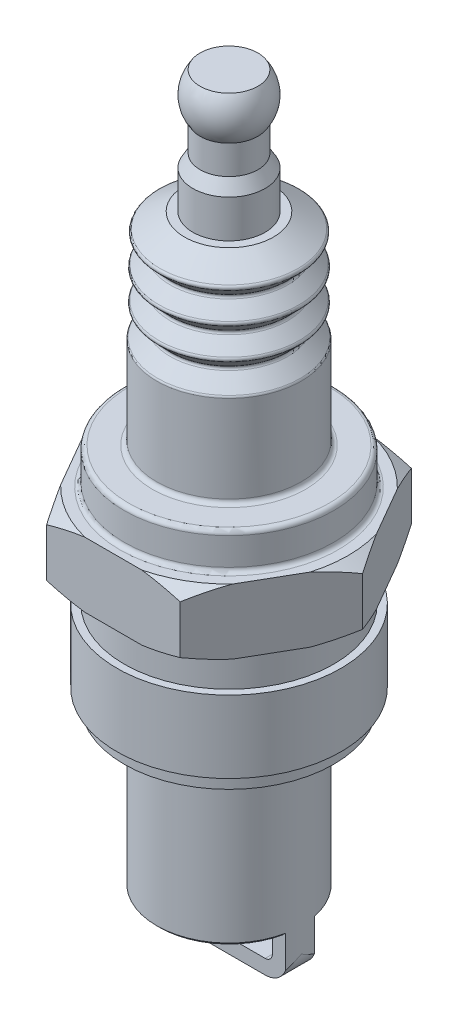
ISO-10303-21;
HEADER;
FILE_DESCRIPTION(('STEP AP214'),'2;1');
FILE_NAME('part.step','',(''),(''),'','','');
FILE_SCHEMA(('AUTOMOTIVE_DESIGN { 1 0 10303 214 1 1 1 1 }'));
ENDSEC;
DATA;
#1=APPLICATION_CONTEXT('core data for automotive mechanical design processes');
#2=APPLICATION_PROTOCOL_DEFINITION('international standard','automotive_design',2000,#1);
#3=PRODUCT_CONTEXT('',#1,'mechanical');
#4=PRODUCT('Part','Part','',(#3));
#5=PRODUCT_RELATED_PRODUCT_CATEGORY('part','',(#4));
#6=PRODUCT_DEFINITION_FORMATION('','',#4);
#7=PRODUCT_DEFINITION_CONTEXT('part definition',#1,'design');
#8=PRODUCT_DEFINITION('design','',#6,#7);
#9=PRODUCT_DEFINITION_SHAPE('','',#8);
#10=(LENGTH_UNIT() NAMED_UNIT(*) SI_UNIT(.MILLI.,.METRE.));
#11=(NAMED_UNIT(*) PLANE_ANGLE_UNIT() SI_UNIT($,.RADIAN.));
#12=(NAMED_UNIT(*) SI_UNIT($,.STERADIAN.) SOLID_ANGLE_UNIT());
#13=UNCERTAINTY_MEASURE_WITH_UNIT(LENGTH_MEASURE(1.E-05),#10,'distance_accuracy_value','');
#14=(GEOMETRIC_REPRESENTATION_CONTEXT(3) GLOBAL_UNCERTAINTY_ASSIGNED_CONTEXT((#13)) GLOBAL_UNIT_ASSIGNED_CONTEXT((#10,
#11,#12)) REPRESENTATION_CONTEXT('',''));
#15=CARTESIAN_POINT('',(0.,0.,0.));
#16=DIRECTION('',(0.,0.,1.));
#17=DIRECTION('',(1.,0.,0.));
#18=AXIS2_PLACEMENT_3D('',#15,#16,#17);
#19=CARTESIAN_POINT('',(0.,38.,0.));
#20=DIRECTION('',(0.,1.,0.));
#21=DIRECTION('',(0.,0.,1.));
#22=AXIS2_PLACEMENT_3D('',#19,#20,#21);
#23=PLANE('',#22);
#24=CARTESIAN_POINT('',(-1.99999999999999,38.,0.));
#25=CARTESIAN_POINT('',(-1.99999966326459,38.,-0.0561537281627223));
#26=CARTESIAN_POINT('',(-1.99763295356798,38.,-0.11231777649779));
#27=CARTESIAN_POINT('',(-1.98818150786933,38.,-0.224257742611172));
#28=CARTESIAN_POINT('',(-1.98109537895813,38.,-0.280033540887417));
#29=CARTESIAN_POINT('',(-1.96223695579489,38.,-0.39088381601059));
#30=CARTESIAN_POINT('',(-1.95045722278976,38.,-0.445957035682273));
#31=CARTESIAN_POINT('',(-1.92229286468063,38.,-0.554945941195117));
#32=CARTESIAN_POINT('',(-1.90590450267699,38.,-0.608860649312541));
#33=CARTESIAN_POINT('',(-1.85005263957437,38.,-0.768058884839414));
#34=CARTESIAN_POINT('',(-1.80385648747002,38.,-0.871064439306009));
#35=CARTESIAN_POINT('',(-1.69480474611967,38.,-1.06784493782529));
#36=CARTESIAN_POINT('',(-1.63194852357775,38.,-1.16161953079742));
#37=CARTESIAN_POINT('',(-1.52659153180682,38.,-1.29332617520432));
#38=CARTESIAN_POINT('',(-1.48959927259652,38.,-1.33576066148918));
#39=CARTESIAN_POINT('',(-1.41221312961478,38.,-1.41732574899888));
#40=CARTESIAN_POINT('',(-1.37182255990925,38.,-1.45645949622));
#41=CARTESIAN_POINT('',(-1.24587628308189,38.,-1.56856725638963));
#42=CARTESIAN_POINT('',(-1.15552317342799,38.,-1.6362762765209));
#43=CARTESIAN_POINT('',(-0.964781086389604,38.,-1.75552410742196));
#44=CARTESIAN_POINT('',(-0.864392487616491,38.,-1.80706352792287));
#45=CARTESIAN_POINT('',(-0.65637628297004,38.,-1.89256650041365));
#46=CARTESIAN_POINT('',(-0.548748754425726,38.,-1.92653024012));
#47=CARTESIAN_POINT('',(-0.329321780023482,38.,-1.97590388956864));
#48=CARTESIAN_POINT('',(-0.217522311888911,38.,-1.99131370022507));
#49=CARTESIAN_POINT('',(0.00707692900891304,38.,-2.00314655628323));
#50=CARTESIAN_POINT('',(0.119876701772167,38.,-1.99956960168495));
#51=CARTESIAN_POINT('',(0.343276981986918,38.,-1.97352600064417));
#52=CARTESIAN_POINT('',(0.453877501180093,38.,-1.95105945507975));
#53=CARTESIAN_POINT('',(0.669726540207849,38.,-1.88788753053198));
#54=CARTESIAN_POINT('',(0.774975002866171,38.,-1.84718195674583));
#55=CARTESIAN_POINT('',(0.97719135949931,38.,-1.74863687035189));
#56=CARTESIAN_POINT('',(1.0741589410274,38.,-1.69079671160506));
#57=CARTESIAN_POINT('',(1.21118793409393,38.,-1.59254362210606));
#58=CARTESIAN_POINT('',(1.25546696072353,38.,-1.55787063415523));
#59=CARTESIAN_POINT('',(1.34099531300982,38.,-1.48488858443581));
#60=CARTESIAN_POINT('',(1.38224167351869,38.,-1.44657604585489));
#61=CARTESIAN_POINT('',(1.50085475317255,38.,-1.32666911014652));
#62=CARTESIAN_POINT('',(1.57321655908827,38.,-1.24001838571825));
#63=CARTESIAN_POINT('',(1.70234169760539,38.,-1.05578607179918));
#64=CARTESIAN_POINT('',(1.75910562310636,38.,-0.958204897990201));
#65=CARTESIAN_POINT('',(1.83137636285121,38.,-0.805756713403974));
#66=CARTESIAN_POINT('',(1.85333919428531,38.,-0.753862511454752));
#67=CARTESIAN_POINT('',(1.89279986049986,38.,-0.648436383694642));
#68=CARTESIAN_POINT('',(1.91030130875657,38.,-0.594905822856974));
#69=CARTESIAN_POINT('',(1.94070314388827,38.,-0.486650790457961));
#70=CARTESIAN_POINT('',(1.95361079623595,38.,-0.43192835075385));
#71=CARTESIAN_POINT('',(1.97477223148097,38.,-0.321601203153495));
#72=CARTESIAN_POINT('',(1.98302738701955,38.,-0.265996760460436));
#73=CARTESIAN_POINT('',(1.9926158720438,38.,-0.175255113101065));
#74=CARTESIAN_POINT('',(1.99538404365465,38.,-0.140263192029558));
#75=CARTESIAN_POINT('',(1.99907621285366,38.,-0.0701821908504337));
#76=CARTESIAN_POINT('',(2.00000021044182,38.,-0.0350931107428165));
#77=CARTESIAN_POINT('',(1.99999966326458,38.,0.0561537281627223));
#78=CARTESIAN_POINT('',(1.99763295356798,38.,0.11231777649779));
#79=CARTESIAN_POINT('',(1.98818150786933,38.,0.224257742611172));
#80=CARTESIAN_POINT('',(1.98109537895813,38.,0.280033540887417));
#81=CARTESIAN_POINT('',(1.96223695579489,38.,0.390883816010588));
#82=CARTESIAN_POINT('',(1.95045722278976,38.,0.44595703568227));
#83=CARTESIAN_POINT('',(1.92229286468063,38.,0.554945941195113));
#84=CARTESIAN_POINT('',(1.90590450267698,38.,0.608860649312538));
#85=CARTESIAN_POINT('',(1.85005263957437,38.,0.768058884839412));
#86=CARTESIAN_POINT('',(1.80385648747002,38.,0.871064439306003));
#87=CARTESIAN_POINT('',(1.69480474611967,38.,1.06784493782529));
#88=CARTESIAN_POINT('',(1.63194852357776,38.,1.16161953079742));
#89=CARTESIAN_POINT('',(1.52659153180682,38.,1.29332617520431));
#90=CARTESIAN_POINT('',(1.48959927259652,38.,1.33576066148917));
#91=CARTESIAN_POINT('',(1.41221312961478,38.,1.41732574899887));
#92=CARTESIAN_POINT('',(1.37182255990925,38.,1.45645949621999));
#93=CARTESIAN_POINT('',(1.2458762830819,38.,1.56856725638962));
#94=CARTESIAN_POINT('',(1.155523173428,38.,1.63627627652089));
#95=CARTESIAN_POINT('',(0.964781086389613,38.,1.75552410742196));
#96=CARTESIAN_POINT('',(0.864392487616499,38.,1.80706352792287));
#97=CARTESIAN_POINT('',(0.656376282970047,38.,1.89256650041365));
#98=CARTESIAN_POINT('',(0.54874875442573,38.,1.92653024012));
#99=CARTESIAN_POINT('',(0.329321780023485,38.,1.97590388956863));
#100=CARTESIAN_POINT('',(0.217522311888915,38.,1.99131370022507));
#101=CARTESIAN_POINT('',(-0.00707692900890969,38.,2.00314655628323));
#102=CARTESIAN_POINT('',(-0.119876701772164,38.,1.99956960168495));
#103=CARTESIAN_POINT('',(-0.343276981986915,38.,1.97352600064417));
#104=CARTESIAN_POINT('',(-0.453877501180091,38.,1.95105945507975));
#105=CARTESIAN_POINT('',(-0.669726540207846,38.,1.88788753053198));
#106=CARTESIAN_POINT('',(-0.774975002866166,38.,1.84718195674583));
#107=CARTESIAN_POINT('',(-0.977191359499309,38.,1.74863687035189));
#108=CARTESIAN_POINT('',(-1.0741589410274,38.,1.69079671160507));
#109=CARTESIAN_POINT('',(-1.21118793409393,38.,1.59254362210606));
#110=CARTESIAN_POINT('',(-1.25546696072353,38.,1.55787063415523));
#111=CARTESIAN_POINT('',(-1.34099531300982,38.,1.48488858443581));
#112=CARTESIAN_POINT('',(-1.38224167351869,38.,1.44657604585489));
#113=CARTESIAN_POINT('',(-1.50085475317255,38.,1.32666911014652));
#114=CARTESIAN_POINT('',(-1.57321655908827,38.,1.24001838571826));
#115=CARTESIAN_POINT('',(-1.70234169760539,38.,1.05578607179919));
#116=CARTESIAN_POINT('',(-1.75910562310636,38.,0.958204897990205));
#117=CARTESIAN_POINT('',(-1.83137636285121,38.,0.805756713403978));
#118=CARTESIAN_POINT('',(-1.85333919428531,38.,0.753862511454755));
#119=CARTESIAN_POINT('',(-1.89279986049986,38.,0.648436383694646));
#120=CARTESIAN_POINT('',(-1.91030130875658,38.,0.59490582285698));
#121=CARTESIAN_POINT('',(-1.94070314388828,38.,0.486650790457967));
#122=CARTESIAN_POINT('',(-1.95361079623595,38.,0.431928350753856));
#123=CARTESIAN_POINT('',(-1.97477223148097,38.,0.321601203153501));
#124=CARTESIAN_POINT('',(-1.98302738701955,38.,0.265996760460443));
#125=CARTESIAN_POINT('',(-1.9926158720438,38.,0.175255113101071));
#126=CARTESIAN_POINT('',(-1.99538404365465,38.,0.140263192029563));
#127=CARTESIAN_POINT('',(-1.99907621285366,38.,0.070182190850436));
#128=CARTESIAN_POINT('',(-2.00000021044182,38.,0.0350931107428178));
#129=CARTESIAN_POINT('',(-1.99999999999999,38.,0.));
#130=B_SPLINE_CURVE_WITH_KNOTS('',3,(#24,#25,#26,#27,#28,#29,#30,#31,#32,#33,#34,#35,#36,#37,
#38,#39,#40,#41,#42,#43,#44,#45,#46,#47,#48,#49,#50,#51,#52,#53,#54,#55,#56,#57,#58,#59,#60,#61,
#62,#63,#64,#65,#66,#67,#68,#69,#70,#71,#72,#73,#74,#75,#76,#77,#78,#79,#80,#81,#82,#83,#84,#85,
#86,#87,#88,#89,#90,#91,#92,#93,#94,#95,#96,#97,#98,#99,#100,#101,#102,#103,#104,#105,#106,#107,
#108,#109,#110,#111,#112,#113,#114,#115,#116,#117,#118,#119,#120,#121,#122,#123,#124,#125,#126,
#127,#128,#129),.UNSPECIFIED.,.T.,.F.,(4,2,2,2,2,2,2,2,2,2,2,2,2,2,2,2,2,2,2,2,2,2,2,2,2,2,2,2,
2,2,2,2,2,2,2,2,2,2,2,2,2,2,2,2,2,2,2,2,2,2,2,2,4),(0.,0.168428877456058,0.336907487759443,
0.505654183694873,0.674538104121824,1.01150089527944,1.34847649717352,1.51718508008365,
1.68573100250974,2.0227147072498,2.35968570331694,2.69665310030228,3.03362229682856,
3.37059149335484,3.70755889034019,4.04452988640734,4.3815135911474,4.55005951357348,
4.71876809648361,5.05574369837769,5.3927064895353,5.56159040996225,5.73033710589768,
5.89881571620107,6.06724459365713,6.17250373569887,6.27776287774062,6.44619175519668,
6.61467036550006,6.78341706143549,6.95230098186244,7.28926377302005,7.62623937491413,
7.79494795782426,7.96349388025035,8.30047758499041,8.63744858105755,8.97441597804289,
9.31138517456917,9.64835437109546,9.9853217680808,10.322292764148,10.659276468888,
10.8278223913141,10.9965309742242,11.3335065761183,11.6704693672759,11.8393532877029,
12.0080999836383,12.1765785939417,12.3450074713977,12.4502666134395,12.5555257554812),.UNSPECIFIED.);
#131=CARTESIAN_POINT('',(-1.99999999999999,38.,0.));
#132=VERTEX_POINT('',#131);
#133=EDGE_CURVE('E297',#132,#132,#130,.T.);
#134=ORIENTED_EDGE('',*,*,#133,.F.);
#135=EDGE_LOOP('',(#134));
#136=FACE_BOUND('',#135,.T.);
#137=ADVANCED_FACE('F16',(#136),#23,.T.);
#138=CARTESIAN_POINT('',(0.,36.5,0.));
#139=DIRECTION('',(1.,0.,0.));
#140=DIRECTION('',(0.,1.,0.));
#141=AXIS2_PLACEMENT_3D('',#138,#139,#140);
#142=SPHERICAL_SURFACE('',#141,2.50000000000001);
#143=CARTESIAN_POINT('',(-2.50000000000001,36.5,0.));
#144=VERTEX_POINT('',#143);
#145=VERTEX_LOOP('',#144);
#146=FACE_BOUND('',#145,.T.);
#147=ORIENTED_EDGE('',*,*,#133,.T.);
#148=EDGE_LOOP('',(#147));
#149=FACE_BOUND('',#148,.T.);
#150=CARTESIAN_POINT('',(0.,35.,0.));
#151=DIRECTION('',(0.,-1.,0.));
#152=DIRECTION('',(0.,0.,-1.));
#153=AXIS2_PLACEMENT_3D('',#150,#151,#152);
#154=CIRCLE('',#153,2.);
#155=CARTESIAN_POINT('',(2.00000000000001,35.,0.));
#156=VERTEX_POINT('',#155);
#157=EDGE_CURVE('E290',#156,#156,#154,.T.);
#158=ORIENTED_EDGE('',*,*,#157,.F.);
#159=CARTESIAN_POINT('',(2.50000000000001,36.5,0.));
#160=CARTESIAN_POINT('',(2.50000039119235,36.4664843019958,0.));
#161=CARTESIAN_POINT('',(2.49932603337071,36.4329686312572,0.));
#162=CARTESIAN_POINT('',(2.4966306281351,36.3659914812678,0.));
#163=CARTESIAN_POINT('',(2.49460958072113,36.3325300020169,0.));
#164=CARTESIAN_POINT('',(2.48922360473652,36.2657153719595,0.));
#165=CARTESIAN_POINT('',(2.48585867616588,36.232362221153,0.));
#166=CARTESIAN_POINT('',(2.47779050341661,36.1658181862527,0.));
#167=CARTESIAN_POINT('',(2.47308725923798,36.132627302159,0.));
#168=CARTESIAN_POINT('',(2.46235002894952,36.0664614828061,0.));
#169=CARTESIAN_POINT('',(2.45631604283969,36.0334865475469,0.));
#170=CARTESIAN_POINT('',(2.44292709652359,35.9678059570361,0.));
#171=CARTESIAN_POINT('',(2.43557213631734,35.9351003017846,0.));
#172=CARTESIAN_POINT('',(2.41955313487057,35.8700111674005,0.));
#173=CARTESIAN_POINT('',(2.41088909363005,35.837627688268,0.));
#174=CARTESIAN_POINT('',(2.39226594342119,35.7732352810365,0.));
#175=CARTESIAN_POINT('',(2.38230683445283,35.7412263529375,0.));
#176=CARTESIAN_POINT('',(2.36110965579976,35.6776348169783,0.));
#177=CARTESIAN_POINT('',(2.34987158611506,35.6460522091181,0.));
#178=CARTESIAN_POINT('',(2.32613466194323,35.5833643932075,0.));
#179=CARTESIAN_POINT('',(2.31363580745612,35.5522591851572,0.));
#180=CARTESIAN_POINT('',(2.2873975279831,35.4905764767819,0.));
#181=CARTESIAN_POINT('',(2.27365810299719,35.4599989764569,0.));
#182=CARTESIAN_POINT('',(2.24496090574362,35.3994211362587,0.));
#183=CARTESIAN_POINT('',(2.23000313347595,35.3694207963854,0.));
#184=CARTESIAN_POINT('',(2.19889342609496,35.31004580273,0.));
#185=CARTESIAN_POINT('',(2.18274149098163,35.2806711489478,0.));
#186=CARTESIAN_POINT('',(2.1492696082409,35.222595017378,0.));
#187=CARTESIAN_POINT('',(2.13194966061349,35.1938935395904,0.));
#188=CARTESIAN_POINT('',(2.09616966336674,35.1372102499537,0.));
#189=CARTESIAN_POINT('',(2.0777096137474,35.1092284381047,0.));
#190=CARTESIAN_POINT('',(2.03967964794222,35.0540294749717,0.));
#191=CARTESIAN_POINT('',(2.02010973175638,35.0268123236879,0.));
#192=CARTESIAN_POINT('',(2.00000000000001,35.,0.));
#193=B_SPLINE_CURVE_WITH_KNOTS('',3,(#159,#160,#161,#162,#163,#164,#165,#166,#167,#168,#169,
#170,#171,#172,#173,#174,#175,#176,#177,#178,#179,#180,#181,#182,#183,#184,#185,#186,#187,#188,
#189,#190,#191,#192),.UNSPECIFIED.,.F.,.F.,(4,2,2,2,2,2,2,2,2,2,2,2,2,2,2,2,4),(0.,
0.100540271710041,0.201080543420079,0.301620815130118,0.402161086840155,0.502701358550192,
0.603241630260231,0.703781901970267,0.804322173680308,0.904862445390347,1.00540271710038,
1.10594298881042,1.20648326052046,1.3070235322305,1.40756380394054,1.50810407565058,
1.60864434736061),.UNSPECIFIED.);
#194=CARTESIAN_POINT('',(2.50000000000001,36.5,0.));
#195=VERTEX_POINT('',#194);
#196=EDGE_CURVE('E294',#195,#156,#193,.T.);
#197=ORIENTED_EDGE('',*,*,#196,.F.);
#198=ORIENTED_EDGE('',*,*,#196,.T.);
#199=EDGE_LOOP('',(#158,#197,#198));
#200=FACE_BOUND('',#199,.T.);
#201=ADVANCED_FACE('F305',(#146,#149,#200),#142,.T.);
#202=CARTESIAN_POINT('',(0.,29.5,0.));
#203=DIRECTION('',(0.,-1.,0.));
#204=DIRECTION('',(0.,0.,-1.));
#205=AXIS2_PLACEMENT_3D('',#202,#203,#204);
#206=CYLINDRICAL_SURFACE('',#205,2.);
#207=CARTESIAN_POINT('',(0.,32.9999999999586,0.));
#208=DIRECTION('',(0.,-1.,0.));
#209=DIRECTION('',(0.,0.,-1.));
#210=AXIS2_PLACEMENT_3D('',#207,#208,#209);
#211=CIRCLE('',#210,2.00000000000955);
#212=CARTESIAN_POINT('',(0.,32.9999999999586,-2.00000000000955));
#213=VERTEX_POINT('',#212);
#214=EDGE_CURVE('E293',#213,#213,#211,.T.);
#215=ORIENTED_EDGE('',*,*,#214,.F.);
#216=EDGE_LOOP('',(#215));
#217=FACE_BOUND('',#216,.T.);
#218=ORIENTED_EDGE('',*,*,#157,.T.);
#219=EDGE_LOOP('',(#218));
#220=FACE_BOUND('',#219,.T.);
#221=ADVANCED_FACE('F318',(#217,#220),#206,.T.);
#222=CARTESIAN_POINT('',(0.,32.1250000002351,0.));
#223=DIRECTION('',(0.,-1.,0.));
#224=DIRECTION('',(0.,0.,-1.));
#225=AXIS2_PLACEMENT_3D('',#222,#223,#224);
#226=CONICAL_SURFACE('',#225,2.49999999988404,0.519146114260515);
#227=CARTESIAN_POINT('',(0.,32.125,0.));
#228=DIRECTION('',(0.,-1.,0.));
#229=DIRECTION('',(0.,0.,-1.));
#230=AXIS2_PLACEMENT_3D('',#227,#228,#229);
#231=CIRCLE('',#230,2.5);
#232=CARTESIAN_POINT('',(0.,32.125,-2.5));
#233=VERTEX_POINT('',#232);
#234=EDGE_CURVE('E289',#233,#233,#231,.T.);
#235=ORIENTED_EDGE('',*,*,#234,.F.);
#236=EDGE_LOOP('',(#235));
#237=FACE_BOUND('',#236,.T.);
#238=ORIENTED_EDGE('',*,*,#214,.T.);
#239=EDGE_LOOP('',(#238));
#240=FACE_BOUND('',#239,.T.);
#241=ADVANCED_FACE('F1156',(#237,#240),#226,.T.);
#242=CARTESIAN_POINT('',(0.,29.5,0.));
#243=DIRECTION('',(0.,-1.,0.));
#244=DIRECTION('',(0.,0.,-1.));
#245=AXIS2_PLACEMENT_3D('',#242,#243,#244);
#246=CYLINDRICAL_SURFACE('',#245,2.5);
#247=CARTESIAN_POINT('',(0.,29.5,0.));
#248=DIRECTION('',(0.,-1.,0.));
#249=DIRECTION('',(0.,0.,-1.));
#250=AXIS2_PLACEMENT_3D('',#247,#248,#249);
#251=CIRCLE('',#250,2.5);
#252=CARTESIAN_POINT('',(0.,29.5,-2.5));
#253=VERTEX_POINT('',#252);
#254=EDGE_CURVE('E286',#253,#253,#251,.T.);
#255=ORIENTED_EDGE('',*,*,#254,.F.);
#256=EDGE_LOOP('',(#255));
#257=FACE_BOUND('',#256,.T.);
#258=ORIENTED_EDGE('',*,*,#234,.T.);
#259=EDGE_LOOP('',(#258));
#260=FACE_BOUND('',#259,.T.);
#261=ADVANCED_FACE('F1147',(#257,#260),#246,.T.);
#262=CARTESIAN_POINT('',(0.,29.5,0.));
#263=DIRECTION('',(0.,1.,0.));
#264=DIRECTION('',(0.,0.,1.));
#265=AXIS2_PLACEMENT_3D('',#262,#263,#264);
#266=PLANE('',#265);
#267=ORIENTED_EDGE('',*,*,#254,.T.);
#268=EDGE_LOOP('',(#267));
#269=FACE_BOUND('',#268,.T.);
#270=CARTESIAN_POINT('',(0.,29.499999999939,0.));
#271=DIRECTION('',(0.,-1.,0.));
#272=DIRECTION('',(0.,0.,-1.));
#273=AXIS2_PLACEMENT_3D('',#270,#271,#272);
#274=CIRCLE('',#273,3.0749640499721);
#275=CARTESIAN_POINT('',(0.,29.499999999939,-3.0749640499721));
#276=VERTEX_POINT('',#275);
#277=EDGE_CURVE('E282',#276,#276,#274,.T.);
#278=ORIENTED_EDGE('',*,*,#277,.F.);
#279=EDGE_LOOP('',(#278));
#280=FACE_BOUND('',#279,.T.);
#281=ADVANCED_FACE('F1138',(#269,#280),#266,.T.);
#282=CARTESIAN_POINT('',(0.,28.475590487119,0.));
#283=DIRECTION('',(0.,-1.,0.));
#284=DIRECTION('',(0.,0.,-1.));
#285=AXIS2_PLACEMENT_3D('',#282,#283,#284);
#286=CONICAL_SURFACE('',#285,4.78051517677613,1.02991185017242);
#287=CARTESIAN_POINT('',(0.,28.4755904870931,0.));
#288=DIRECTION('',(0.,1.,0.));
#289=DIRECTION('',(0.,0.,1.));
#290=AXIS2_PLACEMENT_3D('',#287,#288,#289);
#291=CIRCLE('',#290,4.78051517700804);
#292=CARTESIAN_POINT('',(0.,28.4755904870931,4.78051517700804));
#293=VERTEX_POINT('',#292);
#294=EDGE_CURVE('E285',#293,#293,#291,.F.);
#295=ORIENTED_EDGE('',*,*,#294,.F.);
#296=EDGE_LOOP('',(#295));
#297=FACE_BOUND('',#296,.T.);
#298=ORIENTED_EDGE('',*,*,#277,.T.);
#299=EDGE_LOOP('',(#298));
#300=FACE_BOUND('',#299,.T.);
#301=ADVANCED_FACE('F1129',(#297,#300),#286,.T.);
#302=CARTESIAN_POINT('',(0.,28.3041397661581,0.));
#303=DIRECTION('',(0.,1.,0.));
#304=DIRECTION('',(0.,0.,1.));
#305=AXIS2_PLACEMENT_3D('',#302,#303,#304);
#306=TOROIDAL_SURFACE('',#305,4.67753629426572,0.2);
#307=ORIENTED_EDGE('',*,*,#294,.T.);
#308=EDGE_LOOP('',(#307));
#309=FACE_BOUND('',#308,.T.);
#310=CARTESIAN_POINT('',(0.,28.1627184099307,0.));
#311=DIRECTION('',(0.,1.,0.));
#312=DIRECTION('',(0.,0.,1.));
#313=AXIS2_PLACEMENT_3D('',#310,#311,#312);
#314=CIRCLE('',#313,4.81895765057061);
#315=CARTESIAN_POINT('',(0.,28.1627184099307,4.81895765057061));
#316=VERTEX_POINT('',#315);
#317=EDGE_CURVE('E1622',#316,#316,#314,.F.);
#318=ORIENTED_EDGE('',*,*,#317,.F.);
#319=EDGE_LOOP('',(#318));
#320=FACE_BOUND('',#319,.T.);
#321=ADVANCED_FACE('F1120',(#309,#320),#306,.T.);
#322=CARTESIAN_POINT('',(0.,28.1627184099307,0.));
#323=DIRECTION('',(0.,1.,0.));
#324=DIRECTION('',(-1.,0.,0.));
#325=AXIS2_PLACEMENT_3D('',#322,#323,#324);
#326=CONICAL_SURFACE('',#325,4.81895765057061,0.785398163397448);
#327=ORIENTED_EDGE('',*,*,#317,.T.);
#328=EDGE_LOOP('',(#327));
#329=FACE_BOUND('',#328,.T.);
#330=CARTESIAN_POINT('',(0.,27.4133751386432,0.));
#331=DIRECTION('',(0.,-1.,0.));
#332=DIRECTION('',(0.,0.,-1.));
#333=AXIS2_PLACEMENT_3D('',#330,#331,#332);
#334=CIRCLE('',#333,4.0696143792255);
#335=CARTESIAN_POINT('',(0.,27.4133751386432,-4.0696143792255));
#336=VERTEX_POINT('',#335);
#337=EDGE_CURVE('E1625',#336,#336,#334,.F.);
#338=ORIENTED_EDGE('',*,*,#337,.T.);
#339=EDGE_LOOP('',(#338));
#340=FACE_BOUND('',#339,.T.);
#341=ADVANCED_FACE('F1111',(#329,#340),#326,.T.);
#342=CARTESIAN_POINT('',(0.,27.2719537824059,0.));
#343=DIRECTION('',(0.,-1.,0.));
#344=DIRECTION('',(0.,0.,-1.));
#345=AXIS2_PLACEMENT_3D('',#342,#343,#344);
#346=TOROIDAL_SURFACE('',#345,4.21103573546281,0.2);
#347=ORIENTED_EDGE('',*,*,#337,.F.);
#348=EDGE_LOOP('',(#347));
#349=FACE_BOUND('',#348,.T.);
#350=CARTESIAN_POINT('',(0.,27.130532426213,0.));
#351=DIRECTION('',(0.,-1.,0.));
#352=DIRECTION('',(0.,0.,-1.));
#353=AXIS2_PLACEMENT_3D('',#350,#351,#352);
#354=CIRCLE('',#353,4.06961437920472);
#355=CARTESIAN_POINT('',(0.,27.130532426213,-4.06961437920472));
#356=VERTEX_POINT('',#355);
#357=EDGE_CURVE('E1628',#356,#356,#354,.T.);
#358=ORIENTED_EDGE('',*,*,#357,.F.);
#359=EDGE_LOOP('',(#358));
#360=FACE_BOUND('',#359,.T.);
#361=ADVANCED_FACE('F1102',(#349,#360),#346,.F.);
#362=CARTESIAN_POINT('',(0.,26.3415681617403,0.));
#363=DIRECTION('',(0.,-1.,0.));
#364=DIRECTION('',(0.,0.,-1.));
#365=AXIS2_PLACEMENT_3D('',#362,#363,#364);
#366=CONICAL_SURFACE('',#365,4.85857864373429,0.785398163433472);
#367=CARTESIAN_POINT('',(0.,26.3415681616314,0.));
#368=DIRECTION('',(0.,1.,0.));
#369=DIRECTION('',(0.,0.,1.));
#370=AXIS2_PLACEMENT_3D('',#367,#368,#369);
#371=CIRCLE('',#370,4.85857864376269);
#372=CARTESIAN_POINT('',(0.,26.3415681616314,4.85857864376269));
#373=VERTEX_POINT('',#372);
#374=EDGE_CURVE('E1631',#373,#373,#371,.F.);
#375=ORIENTED_EDGE('',*,*,#374,.F.);
#376=EDGE_LOOP('',(#375));
#377=FACE_BOUND('',#376,.T.);
#378=ORIENTED_EDGE('',*,*,#357,.T.);
#379=EDGE_LOOP('',(#378));
#380=FACE_BOUND('',#379,.T.);
#381=ADVANCED_FACE('F1093',(#377,#380),#366,.T.);
#382=CARTESIAN_POINT('',(0.,26.2001468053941,0.));
#383=DIRECTION('',(0.,1.,0.));
#384=DIRECTION('',(0.,0.,1.));
#385=AXIS2_PLACEMENT_3D('',#382,#383,#384);
#386=TOROIDAL_SURFACE('',#385,4.71715728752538,0.2);
#387=ORIENTED_EDGE('',*,*,#374,.T.);
#388=EDGE_LOOP('',(#387));
#389=FACE_BOUND('',#388,.T.);
#390=CARTESIAN_POINT('',(0.,26.0587254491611,0.));
#391=DIRECTION('',(0.,1.,0.));
#392=DIRECTION('',(0.,0.,1.));
#393=AXIS2_PLACEMENT_3D('',#390,#391,#392);
#394=CIRCLE('',#393,4.85857864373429);
#395=CARTESIAN_POINT('',(0.,26.0587254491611,4.85857864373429));
#396=VERTEX_POINT('',#395);
#397=EDGE_CURVE('E1634',#396,#396,#394,.F.);
#398=ORIENTED_EDGE('',*,*,#397,.F.);
#399=EDGE_LOOP('',(#398));
#400=FACE_BOUND('',#399,.T.);
#401=ADVANCED_FACE('F1084',(#389,#400),#386,.T.);
#402=CARTESIAN_POINT('',(0.,26.0587254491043,0.));
#403=DIRECTION('',(0.,1.,0.));
#404=DIRECTION('',(-1.,0.,0.));
#405=AXIS2_PLACEMENT_3D('',#402,#403,#404);
#406=CONICAL_SURFACE('',#405,4.85857864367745,0.785398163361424);
#407=ORIENTED_EDGE('',*,*,#397,.T.);
#408=EDGE_LOOP('',(#407));
#409=FACE_BOUND('',#408,.T.);
#410=CARTESIAN_POINT('',(0.,25.2697611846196,0.));
#411=DIRECTION('',(0.,-1.,0.));
#412=DIRECTION('',(0.,0.,-1.));
#413=AXIS2_PLACEMENT_3D('',#410,#411,#412);
#414=CIRCLE('',#413,4.06961437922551);
#415=CARTESIAN_POINT('',(0.,25.2697611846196,-4.06961437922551));
#416=VERTEX_POINT('',#415);
#417=EDGE_CURVE('E1637',#416,#416,#414,.F.);
#418=ORIENTED_EDGE('',*,*,#417,.T.);
#419=EDGE_LOOP('',(#418));
#420=FACE_BOUND('',#419,.T.);
#421=ADVANCED_FACE('F1075',(#409,#420),#406,.T.);
#422=CARTESIAN_POINT('',(0.,25.1283398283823,0.));
#423=DIRECTION('',(0.,-1.,0.));
#424=DIRECTION('',(0.,0.,-1.));
#425=AXIS2_PLACEMENT_3D('',#422,#423,#424);
#426=TOROIDAL_SURFACE('',#425,4.21103573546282,0.2);
#427=ORIENTED_EDGE('',*,*,#417,.F.);
#428=EDGE_LOOP('',(#427));
#429=FACE_BOUND('',#428,.T.);
#430=CARTESIAN_POINT('',(0.,24.9869184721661,0.));
#431=DIRECTION('',(0.,-1.,0.));
#432=DIRECTION('',(0.,0.,-1.));
#433=AXIS2_PLACEMENT_3D('',#430,#431,#432);
#434=CIRCLE('',#433,4.06961437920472);
#435=CARTESIAN_POINT('',(0.,24.9869184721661,-4.06961437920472));
#436=VERTEX_POINT('',#435);
#437=EDGE_CURVE('E1640',#436,#436,#434,.T.);
#438=ORIENTED_EDGE('',*,*,#437,.F.);
#439=EDGE_LOOP('',(#438));
#440=FACE_BOUND('',#439,.T.);
#441=ADVANCED_FACE('F1066',(#429,#440),#426,.F.);
#442=CARTESIAN_POINT('',(0.,24.1979542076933,0.));
#443=DIRECTION('',(0.,-1.,0.));
#444=DIRECTION('',(1.,0.,0.));
#445=AXIS2_PLACEMENT_3D('',#442,#443,#444);
#446=CONICAL_SURFACE('',#445,4.85857864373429,0.785398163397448);
#447=CARTESIAN_POINT('',(0.,24.1979542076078,0.));
#448=DIRECTION('',(0.,1.,0.));
#449=DIRECTION('',(0.,0.,1.));
#450=AXIS2_PLACEMENT_3D('',#447,#448,#449);
#451=CIRCLE('',#450,4.85857864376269);
#452=CARTESIAN_POINT('',(0.,24.1979542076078,4.85857864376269));
#453=VERTEX_POINT('',#452);
#454=EDGE_CURVE('E1643',#453,#453,#451,.F.);
#455=ORIENTED_EDGE('',*,*,#454,.F.);
#456=EDGE_LOOP('',(#455));
#457=FACE_BOUND('',#456,.T.);
#458=ORIENTED_EDGE('',*,*,#437,.T.);
#459=EDGE_LOOP('',(#458));
#460=FACE_BOUND('',#459,.T.);
#461=ADVANCED_FACE('F1057',(#457,#460),#446,.T.);
#462=CARTESIAN_POINT('',(0.,24.0565328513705,0.));
#463=DIRECTION('',(0.,1.,0.));
#464=DIRECTION('',(0.,0.,1.));
#465=AXIS2_PLACEMENT_3D('',#462,#463,#464);
#466=TOROIDAL_SURFACE('',#465,4.71715728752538,0.2);
#467=ORIENTED_EDGE('',*,*,#454,.T.);
#468=EDGE_LOOP('',(#467));
#469=FACE_BOUND('',#468,.T.);
#470=CARTESIAN_POINT('',(0.,23.9151114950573,0.));
#471=DIRECTION('',(0.,1.,0.));
#472=DIRECTION('',(0.,0.,1.));
#473=AXIS2_PLACEMENT_3D('',#470,#471,#472);
#474=CIRCLE('',#473,4.85857864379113);
#475=CARTESIAN_POINT('',(0.,23.9151114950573,4.85857864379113));
#476=VERTEX_POINT('',#475);
#477=EDGE_CURVE('E1646',#476,#476,#474,.F.);
#478=ORIENTED_EDGE('',*,*,#477,.F.);
#479=EDGE_LOOP('',(#478));
#480=FACE_BOUND('',#479,.T.);
#481=ADVANCED_FACE('F1048',(#469,#480),#466,.T.);
#482=CARTESIAN_POINT('',(0.,23.9151114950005,0.));
#483=DIRECTION('',(0.,1.,0.));
#484=DIRECTION('',(0.,0.,1.));
#485=AXIS2_PLACEMENT_3D('',#482,#483,#484);
#486=CONICAL_SURFACE('',#485,4.85857864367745,0.785398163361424);
#487=ORIENTED_EDGE('',*,*,#477,.T.);
#488=EDGE_LOOP('',(#487));
#489=FACE_BOUND('',#488,.T.);
#490=CARTESIAN_POINT('',(0.,23.126147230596,0.));
#491=DIRECTION('',(0.,-1.,0.));
#492=DIRECTION('',(0.,0.,-1.));
#493=AXIS2_PLACEMENT_3D('',#490,#491,#492);
#494=CIRCLE('',#493,4.0696143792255);
#495=CARTESIAN_POINT('',(0.,23.126147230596,-4.0696143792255));
#496=VERTEX_POINT('',#495);
#497=EDGE_CURVE('E1649',#496,#496,#494,.F.);
#498=ORIENTED_EDGE('',*,*,#497,.T.);
#499=EDGE_LOOP('',(#498));
#500=FACE_BOUND('',#499,.T.);
#501=ADVANCED_FACE('F1039',(#489,#500),#486,.T.);
#502=CARTESIAN_POINT('',(0.,22.9847258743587,0.));
#503=DIRECTION('',(0.,-1.,0.));
#504=DIRECTION('',(0.,0.,-1.));
#505=AXIS2_PLACEMENT_3D('',#502,#503,#504);
#506=TOROIDAL_SURFACE('',#505,4.21103573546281,0.2);
#507=ORIENTED_EDGE('',*,*,#497,.F.);
#508=EDGE_LOOP('',(#507));
#509=FACE_BOUND('',#508,.T.);
#510=CARTESIAN_POINT('',(0.,22.843304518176,0.));
#511=DIRECTION('',(0.,-1.,0.));
#512=DIRECTION('',(0.,0.,-1.));
#513=AXIS2_PLACEMENT_3D('',#510,#511,#512);
#514=CIRCLE('',#513,4.06961437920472);
#515=CARTESIAN_POINT('',(0.,22.843304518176,-4.06961437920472));
#516=VERTEX_POINT('',#515);
#517=EDGE_CURVE('E1652',#516,#516,#514,.T.);
#518=ORIENTED_EDGE('',*,*,#517,.F.);
#519=EDGE_LOOP('',(#518));
#520=FACE_BOUND('',#519,.T.);
#521=ADVANCED_FACE('F1030',(#509,#520),#506,.F.);
#522=CARTESIAN_POINT('',(0.,21.9714975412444,0.));
#523=DIRECTION('',(0.,-1.,0.));
#524=DIRECTION('',(0.,0.,-1.));
#525=AXIS2_PLACEMENT_3D('',#522,#523,#524);
#526=CONICAL_SURFACE('',#525,4.94142135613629,0.785398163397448);
#527=CARTESIAN_POINT('',(0.,21.9714975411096,0.));
#528=DIRECTION('',(0.,1.,0.));
#529=DIRECTION('',(0.,0.,1.));
#530=AXIS2_PLACEMENT_3D('',#527,#528,#529);
#531=CIRCLE('',#530,4.94142135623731);
#532=CARTESIAN_POINT('',(0.,21.9714975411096,4.94142135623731));
#533=VERTEX_POINT('',#532);
#534=EDGE_CURVE('E1655',#533,#533,#531,.F.);
#535=ORIENTED_EDGE('',*,*,#534,.F.);
#536=EDGE_LOOP('',(#535));
#537=FACE_BOUND('',#536,.T.);
#538=ORIENTED_EDGE('',*,*,#517,.T.);
#539=EDGE_LOOP('',(#538));
#540=FACE_BOUND('',#539,.T.);
#541=ADVANCED_FACE('F1021',(#537,#540),#526,.T.);
#542=CARTESIAN_POINT('',(0.,21.8300761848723,0.));
#543=DIRECTION('',(0.,1.,0.));
#544=DIRECTION('',(0.,0.,1.));
#545=AXIS2_PLACEMENT_3D('',#542,#543,#544);
#546=TOROIDAL_SURFACE('',#545,4.8,0.2);
#547=ORIENTED_EDGE('',*,*,#534,.T.);
#548=EDGE_LOOP('',(#547));
#549=FACE_BOUND('',#548,.T.);
#550=CARTESIAN_POINT('',(0.,21.8300761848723,0.));
#551=DIRECTION('',(0.,-1.,0.));
#552=DIRECTION('',(0.,0.,-1.));
#553=AXIS2_PLACEMENT_3D('',#550,#551,#552);
#554=CIRCLE('',#553,5.);
#555=CARTESIAN_POINT('',(0.,21.8300761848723,-5.));
#556=VERTEX_POINT('',#555);
#557=EDGE_CURVE('E1658',#556,#556,#554,.T.);
#558=ORIENTED_EDGE('',*,*,#557,.F.);
#559=EDGE_LOOP('',(#558));
#560=FACE_BOUND('',#559,.T.);
#561=ADVANCED_FACE('F1012',(#549,#560),#546,.T.);
#562=CARTESIAN_POINT('',(0.,29.5,0.));
#563=DIRECTION('',(0.,-1.,0.));
#564=DIRECTION('',(0.,0.,-1.));
#565=AXIS2_PLACEMENT_3D('',#562,#563,#564);
#566=CYLINDRICAL_SURFACE('',#565,5.);
#567=CARTESIAN_POINT('',(0.,15.8,0.));
#568=DIRECTION('',(0.,1.,0.));
#569=DIRECTION('',(0.,0.,1.));
#570=AXIS2_PLACEMENT_3D('',#567,#568,#569);
#571=CIRCLE('',#570,5.);
#572=CARTESIAN_POINT('',(0.,15.8,5.));
#573=VERTEX_POINT('',#572);
#574=EDGE_CURVE('E1661',#573,#573,#571,.T.);
#575=ORIENTED_EDGE('',*,*,#574,.T.);
#576=EDGE_LOOP('',(#575));
#577=FACE_BOUND('',#576,.T.);
#578=ORIENTED_EDGE('',*,*,#557,.T.);
#579=EDGE_LOOP('',(#578));
#580=FACE_BOUND('',#579,.T.);
#581=ADVANCED_FACE('F1004',(#577,#580),#566,.T.);
#582=CARTESIAN_POINT('',(0.,15.8,0.));
#583=DIRECTION('',(0.,1.,0.));
#584=DIRECTION('',(0.,0.,1.));
#585=AXIS2_PLACEMENT_3D('',#582,#583,#584);
#586=TOROIDAL_SURFACE('',#585,5.3,0.3);
#587=ORIENTED_EDGE('',*,*,#574,.F.);
#588=EDGE_LOOP('',(#587));
#589=FACE_BOUND('',#588,.T.);
#590=CARTESIAN_POINT('',(0.,15.5,0.));
#591=DIRECTION('',(0.,1.,0.));
#592=DIRECTION('',(0.,0.,-1.));
#593=AXIS2_PLACEMENT_3D('',#590,#591,#592);
#594=CIRCLE('',#593,5.3);
#595=CARTESIAN_POINT('',(0.,15.5,5.3));
#596=VERTEX_POINT('',#595);
#597=CARTESIAN_POINT('',(0.,15.5,-5.3));
#598=VERTEX_POINT('',#597);
#599=EDGE_CURVE('E1663',#596,#598,#594,.F.);
#600=ORIENTED_EDGE('',*,*,#599,.F.);
#601=CARTESIAN_POINT('',(0.,15.5,0.));
#602=DIRECTION('',(0.,1.,0.));
#603=DIRECTION('',(0.,0.,1.));
#604=AXIS2_PLACEMENT_3D('',#601,#602,#603);
#605=CIRCLE('',#604,5.3);
#606=EDGE_CURVE('E1709',#598,#596,#605,.F.);
#607=ORIENTED_EDGE('',*,*,#606,.F.);
#608=EDGE_LOOP('',(#600,#607));
#609=FACE_BOUND('',#608,.T.);
#610=ADVANCED_FACE('F996',(#589,#609),#586,.F.);
#611=CARTESIAN_POINT('',(0.,15.5,0.));
#612=DIRECTION('',(0.,1.,0.));
#613=DIRECTION('',(0.,0.,1.));
#614=AXIS2_PLACEMENT_3D('',#611,#612,#613);
#615=PLANE('',#614);
#616=ORIENTED_EDGE('',*,*,#599,.T.);
#617=ORIENTED_EDGE('',*,*,#606,.T.);
#618=EDGE_LOOP('',(#616,#617));
#619=FACE_BOUND('',#618,.T.);
#620=CARTESIAN_POINT('',(0.,15.5,0.));
#621=DIRECTION('',(0.,-1.,0.));
#622=DIRECTION('',(0.,0.,-1.));
#623=AXIS2_PLACEMENT_3D('',#620,#621,#622);
#624=CIRCLE('',#623,6.95);
#625=CARTESIAN_POINT('',(0.,15.5,-6.95));
#626=VERTEX_POINT('',#625);
#627=CARTESIAN_POINT('',(0.,15.5,6.95));
#628=VERTEX_POINT('',#627);
#629=EDGE_CURVE('E611',#626,#628,#624,.T.);
#630=ORIENTED_EDGE('',*,*,#629,.F.);
#631=CARTESIAN_POINT('',(0.,15.5,0.));
#632=DIRECTION('',(0.,-1.,0.));
#633=DIRECTION('',(0.,0.,1.));
#634=AXIS2_PLACEMENT_3D('',#631,#632,#633);
#635=CIRCLE('',#634,6.95);
#636=EDGE_CURVE('E1690',#628,#626,#635,.T.);
#637=ORIENTED_EDGE('',*,*,#636,.F.);
#638=EDGE_LOOP('',(#630,#637));
#639=FACE_BOUND('',#638,.T.);
#640=ADVANCED_FACE('F635',(#619,#639),#615,.T.);
#641=CARTESIAN_POINT('',(0.,15.2,0.));
#642=DIRECTION('',(0.,1.,0.));
#643=DIRECTION('',(0.,0.,1.));
#644=AXIS2_PLACEMENT_3D('',#641,#642,#643);
#645=TOROIDAL_SURFACE('',#644,6.95,0.3);
#646=ORIENTED_EDGE('',*,*,#636,.T.);
#647=ORIENTED_EDGE('',*,*,#629,.T.);
#648=EDGE_LOOP('',(#646,#647));
#649=FACE_BOUND('',#648,.T.);
#650=CARTESIAN_POINT('',(0.,15.2,0.));
#651=DIRECTION('',(0.,-1.,0.));
#652=DIRECTION('',(0.,0.,-1.));
#653=AXIS2_PLACEMENT_3D('',#650,#651,#652);
#654=CIRCLE('',#653,7.25);
#655=CARTESIAN_POINT('',(0.,15.2,-7.25));
#656=VERTEX_POINT('',#655);
#657=EDGE_CURVE('E608',#656,#656,#654,.T.);
#658=ORIENTED_EDGE('',*,*,#657,.F.);
#659=EDGE_LOOP('',(#658));
#660=FACE_BOUND('',#659,.T.);
#661=ADVANCED_FACE('F624',(#649,#660),#645,.T.);
#662=CARTESIAN_POINT('',(0.,15.5,0.));
#663=DIRECTION('',(0.,-1.,0.));
#664=DIRECTION('',(0.,0.,-1.));
#665=AXIS2_PLACEMENT_3D('',#662,#663,#664);
#666=CYLINDRICAL_SURFACE('',#665,7.25);
#667=CARTESIAN_POINT('',(0.,13.3,0.));
#668=DIRECTION('',(0.,-1.,0.));
#669=DIRECTION('',(0.,0.,-1.));
#670=AXIS2_PLACEMENT_3D('',#667,#668,#669);
#671=CIRCLE('',#670,7.25);
#672=CARTESIAN_POINT('',(0.,13.3,-7.25));
#673=VERTEX_POINT('',#672);
#674=EDGE_CURVE('E599',#673,#673,#671,.F.);
#675=ORIENTED_EDGE('',*,*,#674,.T.);
#676=EDGE_LOOP('',(#675));
#677=FACE_BOUND('',#676,.T.);
#678=ORIENTED_EDGE('',*,*,#657,.T.);
#679=EDGE_LOOP('',(#678));
#680=FACE_BOUND('',#679,.T.);
#681=ADVANCED_FACE('F634',(#677,#680),#666,.T.);
#682=CARTESIAN_POINT('',(0.,13.3,0.));
#683=DIRECTION('',(0.,-1.,0.));
#684=DIRECTION('',(0.,0.,-1.));
#685=AXIS2_PLACEMENT_3D('',#682,#683,#684);
#686=TOROIDAL_SURFACE('',#685,7.55,0.3);
#687=CARTESIAN_POINT('',(0.,13.,0.));
#688=DIRECTION('',(0.,1.,0.));
#689=DIRECTION('',(0.,0.,1.));
#690=AXIS2_PLACEMENT_3D('',#687,#688,#689);
#691=CIRCLE('',#690,7.55);
#692=CARTESIAN_POINT('',(0.,13.,7.55));
#693=VERTEX_POINT('',#692);
#694=CARTESIAN_POINT('',(0.,13.,-7.55));
#695=VERTEX_POINT('',#694);
#696=EDGE_CURVE('E191',#693,#695,#691,.T.);
#697=ORIENTED_EDGE('',*,*,#696,.T.);
#698=CARTESIAN_POINT('',(0.,13.,0.));
#699=DIRECTION('',(0.,1.,0.));
#700=DIRECTION('',(0.,0.,-1.));
#701=AXIS2_PLACEMENT_3D('',#698,#699,#700);
#702=CIRCLE('',#701,7.55);
#703=EDGE_CURVE('E607',#695,#693,#702,.T.);
#704=ORIENTED_EDGE('',*,*,#703,.T.);
#705=EDGE_LOOP('',(#697,#704));
#706=FACE_BOUND('',#705,.T.);
#707=ORIENTED_EDGE('',*,*,#674,.F.);
#708=EDGE_LOOP('',(#707));
#709=FACE_BOUND('',#708,.T.);
#710=ADVANCED_FACE('F232',(#706,#709),#686,.F.);
#711=CARTESIAN_POINT('',(0.,12.4191856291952,0.));
#712=DIRECTION('',(0.,-1.,0.));
#713=DIRECTION('',(0.,0.,-1.));
#714=AXIS2_PLACEMENT_3D('',#711,#712,#713);
#715=CONICAL_SURFACE('',#714,9.24360430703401,1.0471975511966);
#716=CARTESIAN_POINT('',(0.,13.,0.));
#717=DIRECTION('',(0.,-1.,0.));
#718=DIRECTION('',(0.,0.,-1.));
#719=AXIS2_PLACEMENT_3D('',#716,#717,#718);
#720=CIRCLE('',#719,8.23760430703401);
#721=CARTESIAN_POINT('',(1.96421096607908,13.,-8.));
#722=VERTEX_POINT('',#721);
#723=CARTESIAN_POINT('',(5.94609774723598,13.,-5.70105659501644));
#724=VERTEX_POINT('',#723);
#725=EDGE_CURVE('E180',#722,#724,#720,.T.);
#726=ORIENTED_EDGE('',*,*,#725,.T.);
#727=CARTESIAN_POINT('',(4.61880215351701,12.4226497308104,-8.));
#728=CARTESIAN_POINT('',(4.72770049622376,12.4855146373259,-7.81138253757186));
#729=CARTESIAN_POINT('',(4.83705521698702,12.5453227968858,-7.62197460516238));
#730=CARTESIAN_POINT('',(5.0565230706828,12.657811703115,-7.24184513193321));
#731=CARTESIAN_POINT('',(5.16663503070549,12.7105016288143,-7.05112562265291));
#732=CARTESIAN_POINT('',(5.38777120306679,12.8079195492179,-6.66810653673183));
#733=CARTESIAN_POINT('',(5.49879561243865,12.8526457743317,-6.47580661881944));
#734=CARTESIAN_POINT('',(5.72179214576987,12.9332358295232,-6.08956529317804));
#735=CARTESIAN_POINT('',(5.83376531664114,12.9690880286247,-5.89562207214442));
#736=CARTESIAN_POINT('',(5.94609774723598,13.,-5.70105659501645));
#737=B_SPLINE_CURVE_WITH_KNOTS('',3,(#727,#728,#729,#730,#731,#732,#733,#734,#735,#736),
.UNSPECIFIED.,.F.,.F.,(4,2,2,2,4),(0.,0.68008385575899,1.35928219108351,2.03863126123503,
2.71886607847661),.UNSPECIFIED.);
#738=CARTESIAN_POINT('',(4.61880215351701,12.4226497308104,-8.));
#739=VERTEX_POINT('',#738);
#740=EDGE_CURVE('E184',#739,#724,#737,.T.);
#741=ORIENTED_EDGE('',*,*,#740,.F.);
#742=CARTESIAN_POINT('',(1.96421096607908,13.,-8.));
#743=CARTESIAN_POINT('',(2.18887582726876,12.9690880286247,-8.));
#744=CARTESIAN_POINT('',(2.41282216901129,12.9332358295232,-8.));
#745=CARTESIAN_POINT('',(2.85881523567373,12.8526457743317,-8.));
#746=CARTESIAN_POINT('',(3.08086405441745,12.8079195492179,-8.));
#747=CARTESIAN_POINT('',(3.52313639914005,12.7105016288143,-8.));
#748=CARTESIAN_POINT('',(3.74336031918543,12.657811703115,-8.));
#749=CARTESIAN_POINT('',(4.18229602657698,12.5453227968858,-8.));
#750=CARTESIAN_POINT('',(4.40100546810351,12.4855146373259,-8.));
#751=CARTESIAN_POINT('',(4.61880215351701,12.4226497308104,-8.));
#752=B_SPLINE_CURVE_WITH_KNOTS('',3,(#742,#743,#744,#745,#746,#747,#748,#749,#750,#751),
.UNSPECIFIED.,.F.,.F.,(4,2,2,2,4),(0.,0.680234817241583,1.35958388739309,2.03878222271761,
2.7188660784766),.UNSPECIFIED.);
#753=EDGE_CURVE('E186',#722,#739,#752,.T.);
#754=ORIENTED_EDGE('',*,*,#753,.F.);
#755=EDGE_LOOP('',(#726,#741,#754));
#756=FACE_BOUND('',#755,.T.);
#757=ADVANCED_FACE('F182',(#756),#715,.T.);
#758=CARTESIAN_POINT('',(0.,12.4191856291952,0.));
#759=DIRECTION('',(0.,-1.,0.));
#760=DIRECTION('',(0.,0.,-1.));
#761=AXIS2_PLACEMENT_3D('',#758,#759,#760);
#762=CONICAL_SURFACE('',#761,9.24360430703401,1.0471975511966);
#763=CARTESIAN_POINT('',(7.91030871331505,13.,-2.29894340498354));
#764=CARTESIAN_POINT('',(8.02264114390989,12.9690880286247,-2.10437792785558));
#765=CARTESIAN_POINT('',(8.13461431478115,12.9332358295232,-1.91043470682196));
#766=CARTESIAN_POINT('',(8.35761084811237,12.8526457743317,-1.52419338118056));
#767=CARTESIAN_POINT('',(8.46863525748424,12.8079195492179,-1.33189346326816));
#768=CARTESIAN_POINT('',(8.68977142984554,12.7105016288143,-0.948874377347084));
#769=CARTESIAN_POINT('',(8.79988338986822,12.657811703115,-0.758154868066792));
#770=CARTESIAN_POINT('',(9.019351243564,12.5453227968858,-0.378025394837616));
#771=CARTESIAN_POINT('',(9.12870596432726,12.4855146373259,-0.188617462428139));
#772=CARTESIAN_POINT('',(9.23760430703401,12.4226497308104,0.));
#773=B_SPLINE_CURVE_WITH_KNOTS('',3,(#763,#764,#765,#766,#767,#768,#769,#770,#771,#772),
.UNSPECIFIED.,.F.,.F.,(4,2,2,2,4),(0.,0.680234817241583,1.35958388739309,2.03878222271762,
2.71886607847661),.UNSPECIFIED.);
#774=CARTESIAN_POINT('',(7.91030871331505,13.,-2.29894340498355));
#775=VERTEX_POINT('',#774);
#776=CARTESIAN_POINT('',(9.23760430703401,12.4226497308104,0.));
#777=VERTEX_POINT('',#776);
#778=EDGE_CURVE('E200',#775,#777,#773,.T.);
#779=ORIENTED_EDGE('',*,*,#778,.F.);
#780=CARTESIAN_POINT('',(0.,13.,0.));
#781=DIRECTION('',(0.,-1.,0.));
#782=DIRECTION('',(0.,0.,-1.));
#783=AXIS2_PLACEMENT_3D('',#780,#781,#782);
#784=CIRCLE('',#783,8.23760430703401);
#785=CARTESIAN_POINT('',(7.91030871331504,13.,2.29894340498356));
#786=VERTEX_POINT('',#785);
#787=EDGE_CURVE('E190',#775,#786,#784,.T.);
#788=ORIENTED_EDGE('',*,*,#787,.T.);
#789=CARTESIAN_POINT('',(9.23760430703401,12.4226497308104,0.));
#790=CARTESIAN_POINT('',(9.12870596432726,12.4855146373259,0.188617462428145));
#791=CARTESIAN_POINT('',(9.019351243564,12.5453227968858,0.378025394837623));
#792=CARTESIAN_POINT('',(8.79988338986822,12.657811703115,0.7581548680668));
#793=CARTESIAN_POINT('',(8.68977142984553,12.7105016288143,0.948874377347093));
#794=CARTESIAN_POINT('',(8.46863525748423,12.8079195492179,1.33189346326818));
#795=CARTESIAN_POINT('',(8.35761084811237,12.8526457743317,1.52419338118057));
#796=CARTESIAN_POINT('',(8.13461431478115,12.9332358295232,1.91043470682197));
#797=CARTESIAN_POINT('',(8.02264114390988,12.9690880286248,2.10437792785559));
#798=CARTESIAN_POINT('',(7.91030871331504,13.,2.29894340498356));
#799=B_SPLINE_CURVE_WITH_KNOTS('',3,(#789,#790,#791,#792,#793,#794,#795,#796,#797,#798),
.UNSPECIFIED.,.F.,.F.,(4,2,2,2,4),(0.,0.680083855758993,1.35928219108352,2.03863126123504,
2.71886607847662),.UNSPECIFIED.);
#800=EDGE_CURVE('E679',#777,#786,#799,.T.);
#801=ORIENTED_EDGE('',*,*,#800,.F.);
#802=EDGE_LOOP('',(#779,#788,#801));
#803=FACE_BOUND('',#802,.T.);
#804=ADVANCED_FACE('F231',(#803),#762,.T.);
#805=CARTESIAN_POINT('',(0.,12.4191856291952,0.));
#806=DIRECTION('',(0.,-1.,0.));
#807=DIRECTION('',(0.,0.,-1.));
#808=AXIS2_PLACEMENT_3D('',#805,#806,#807);
#809=CONICAL_SURFACE('',#808,9.24360430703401,1.0471975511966);
#810=CARTESIAN_POINT('',(0.,13.,0.));
#811=DIRECTION('',(0.,-1.,0.));
#812=DIRECTION('',(0.,0.,-1.));
#813=AXIS2_PLACEMENT_3D('',#810,#811,#812);
#814=CIRCLE('',#813,8.23760430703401);
#815=CARTESIAN_POINT('',(5.94609774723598,13.,5.70105659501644));
#816=VERTEX_POINT('',#815);
#817=CARTESIAN_POINT('',(1.96421096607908,13.,8.));
#818=VERTEX_POINT('',#817);
#819=EDGE_CURVE('E279',#816,#818,#814,.T.);
#820=ORIENTED_EDGE('',*,*,#819,.T.);
#821=CARTESIAN_POINT('',(4.61880215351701,12.4226497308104,8.));
#822=CARTESIAN_POINT('',(4.40100546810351,12.4855146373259,8.));
#823=CARTESIAN_POINT('',(4.18229602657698,12.5453227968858,8.));
#824=CARTESIAN_POINT('',(3.74336031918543,12.657811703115,8.));
#825=CARTESIAN_POINT('',(3.52313639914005,12.7105016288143,8.));
#826=CARTESIAN_POINT('',(3.08086405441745,12.8079195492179,8.));
#827=CARTESIAN_POINT('',(2.85881523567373,12.8526457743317,8.));
#828=CARTESIAN_POINT('',(2.41282216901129,12.9332358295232,8.));
#829=CARTESIAN_POINT('',(2.18887582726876,12.9690880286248,8.));
#830=CARTESIAN_POINT('',(1.96421096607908,13.,8.));
#831=B_SPLINE_CURVE_WITH_KNOTS('',3,(#821,#822,#823,#824,#825,#826,#827,#828,#829,#830),
.UNSPECIFIED.,.F.,.F.,(4,2,2,2,4),(0.,0.68008385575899,1.35928219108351,2.03863126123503,
2.71886607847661),.UNSPECIFIED.);
#832=CARTESIAN_POINT('',(4.61880215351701,12.4226497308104,8.));
#833=VERTEX_POINT('',#832);
#834=EDGE_CURVE('E688',#833,#818,#831,.T.);
#835=ORIENTED_EDGE('',*,*,#834,.F.);
#836=CARTESIAN_POINT('',(5.94609774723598,13.,5.70105659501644));
#837=CARTESIAN_POINT('',(5.83376531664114,12.9690880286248,5.89562207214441));
#838=CARTESIAN_POINT('',(5.72179214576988,12.9332358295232,6.08956529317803));
#839=CARTESIAN_POINT('',(5.49879561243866,12.8526457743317,6.47580661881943));
#840=CARTESIAN_POINT('',(5.38777120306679,12.8079195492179,6.66810653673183));
#841=CARTESIAN_POINT('',(5.16663503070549,12.7105016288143,7.05112562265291));
#842=CARTESIAN_POINT('',(5.0565230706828,12.657811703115,7.2418451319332));
#843=CARTESIAN_POINT('',(4.83705521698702,12.5453227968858,7.62197460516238));
#844=CARTESIAN_POINT('',(4.72770049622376,12.4855146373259,7.81138253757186));
#845=CARTESIAN_POINT('',(4.61880215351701,12.4226497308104,8.));
#846=B_SPLINE_CURVE_WITH_KNOTS('',3,(#836,#837,#838,#839,#840,#841,#842,#843,#844,#845),
.UNSPECIFIED.,.F.,.F.,(4,2,2,2,4),(0.,0.680234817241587,1.3595838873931,2.03878222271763,
2.71886607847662),.UNSPECIFIED.);
#847=EDGE_CURVE('E678',#816,#833,#846,.T.);
#848=ORIENTED_EDGE('',*,*,#847,.F.);
#849=EDGE_LOOP('',(#820,#835,#848));
#850=FACE_BOUND('',#849,.T.);
#851=ADVANCED_FACE('F949',(#850),#809,.T.);
#852=CARTESIAN_POINT('',(0.,12.4191856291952,0.));
#853=DIRECTION('',(0.,-1.,0.));
#854=DIRECTION('',(0.,0.,-1.));
#855=AXIS2_PLACEMENT_3D('',#852,#853,#854);
#856=CONICAL_SURFACE('',#855,9.24360430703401,1.0471975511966);
#857=CARTESIAN_POINT('',(0.,13.,0.));
#858=DIRECTION('',(0.,-1.,0.));
#859=DIRECTION('',(0.,0.,-1.));
#860=AXIS2_PLACEMENT_3D('',#857,#858,#859);
#861=CIRCLE('',#860,8.23760430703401);
#862=CARTESIAN_POINT('',(-1.96421096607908,13.,8.));
#863=VERTEX_POINT('',#862);
#864=CARTESIAN_POINT('',(-5.94609774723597,13.,5.70105659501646));
#865=VERTEX_POINT('',#864);
#866=EDGE_CURVE('E277',#863,#865,#861,.T.);
#867=ORIENTED_EDGE('',*,*,#866,.T.);
#868=CARTESIAN_POINT('',(-4.61880215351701,12.4226497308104,8.));
#869=CARTESIAN_POINT('',(-4.72770049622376,12.4855146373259,7.81138253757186));
#870=CARTESIAN_POINT('',(-4.83705521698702,12.5453227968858,7.62197460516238));
#871=CARTESIAN_POINT('',(-5.05652307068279,12.657811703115,7.24184513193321));
#872=CARTESIAN_POINT('',(-5.16663503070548,12.7105016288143,7.05112562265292));
#873=CARTESIAN_POINT('',(-5.38777120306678,12.8079195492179,6.66810653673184));
#874=CARTESIAN_POINT('',(-5.49879561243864,12.8526457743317,6.47580661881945));
#875=CARTESIAN_POINT('',(-5.72179214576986,12.9332358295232,6.08956529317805));
#876=CARTESIAN_POINT('',(-5.83376531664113,12.9690880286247,5.89562207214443));
#877=CARTESIAN_POINT('',(-5.94609774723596,13.,5.70105659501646));
#878=B_SPLINE_CURVE_WITH_KNOTS('',3,(#868,#869,#870,#871,#872,#873,#874,#875,#876,#877),
.UNSPECIFIED.,.F.,.F.,(4,2,2,2,4),(0.,0.680083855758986,1.35928219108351,2.03863126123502,
2.7188660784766),.UNSPECIFIED.);
#879=CARTESIAN_POINT('',(-4.61880215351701,12.4226497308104,8.));
#880=VERTEX_POINT('',#879);
#881=EDGE_CURVE('E697',#880,#865,#878,.T.);
#882=ORIENTED_EDGE('',*,*,#881,.F.);
#883=CARTESIAN_POINT('',(-1.96421096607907,13.,8.));
#884=CARTESIAN_POINT('',(-2.18887582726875,12.9690880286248,8.));
#885=CARTESIAN_POINT('',(-2.41282216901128,12.9332358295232,8.));
#886=CARTESIAN_POINT('',(-2.85881523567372,12.8526457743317,8.));
#887=CARTESIAN_POINT('',(-3.08086405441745,12.8079195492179,8.));
#888=CARTESIAN_POINT('',(-3.52313639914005,12.7105016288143,8.));
#889=CARTESIAN_POINT('',(-3.74336031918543,12.657811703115,8.));
#890=CARTESIAN_POINT('',(-4.18229602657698,12.5453227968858,8.));
#891=CARTESIAN_POINT('',(-4.4010054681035,12.4855146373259,8.));
#892=CARTESIAN_POINT('',(-4.61880215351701,12.4226497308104,8.));
#893=B_SPLINE_CURVE_WITH_KNOTS('',3,(#883,#884,#885,#886,#887,#888,#889,#890,#891,#892),
.UNSPECIFIED.,.F.,.F.,(4,2,2,2,4),(0.,0.680234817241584,1.3595838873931,2.03878222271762,
2.71886607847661),.UNSPECIFIED.);
#894=EDGE_CURVE('E687',#863,#880,#893,.T.);
#895=ORIENTED_EDGE('',*,*,#894,.F.);
#896=EDGE_LOOP('',(#867,#882,#895));
#897=FACE_BOUND('',#896,.T.);
#898=ADVANCED_FACE('F944',(#897),#856,.T.);
#899=CARTESIAN_POINT('',(0.,12.4191856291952,0.));
#900=DIRECTION('',(0.,-1.,0.));
#901=DIRECTION('',(1.,0.,0.));
#902=AXIS2_PLACEMENT_3D('',#899,#900,#901);
#903=CONICAL_SURFACE('',#902,9.24360430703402,1.0471975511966);
#904=CARTESIAN_POINT('',(0.,13.,0.));
#905=DIRECTION('',(0.,-1.,0.));
#906=DIRECTION('',(1.,0.,0.));
#907=AXIS2_PLACEMENT_3D('',#904,#905,#906);
#908=CIRCLE('',#907,8.23760430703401);
#909=CARTESIAN_POINT('',(-7.91030871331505,13.,2.29894340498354));
#910=VERTEX_POINT('',#909);
#911=CARTESIAN_POINT('',(-7.91030871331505,13.,-2.29894340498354));
#912=VERTEX_POINT('',#911);
#913=EDGE_CURVE('E275',#910,#912,#908,.T.);
#914=ORIENTED_EDGE('',*,*,#913,.T.);
#915=CARTESIAN_POINT('',(-9.23760430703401,12.4226497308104,0.));
#916=CARTESIAN_POINT('',(-9.12870596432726,12.4855146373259,-0.188617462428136));
#917=CARTESIAN_POINT('',(-9.019351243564,12.5453227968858,-0.378025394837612));
#918=CARTESIAN_POINT('',(-8.79988338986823,12.657811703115,-0.758154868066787));
#919=CARTESIAN_POINT('',(-8.68977142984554,12.7105016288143,-0.948874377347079));
#920=CARTESIAN_POINT('',(-8.46863525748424,12.8079195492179,-1.33189346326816));
#921=CARTESIAN_POINT('',(-8.35761084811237,12.8526457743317,-1.52419338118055));
#922=CARTESIAN_POINT('',(-8.13461431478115,12.9332358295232,-1.91043470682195));
#923=CARTESIAN_POINT('',(-8.02264114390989,12.9690880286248,-2.10437792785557));
#924=CARTESIAN_POINT('',(-7.91030871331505,13.,-2.29894340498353));
#925=B_SPLINE_CURVE_WITH_KNOTS('',3,(#915,#916,#917,#918,#919,#920,#921,#922,#923,#924),
.UNSPECIFIED.,.F.,.F.,(4,2,2,2,4),(0.,0.680083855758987,1.35928219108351,2.03863126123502,
2.7188660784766),.UNSPECIFIED.);
#926=CARTESIAN_POINT('',(-9.23760430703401,12.4226497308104,0.));
#927=VERTEX_POINT('',#926);
#928=EDGE_CURVE('E710',#927,#912,#925,.T.);
#929=ORIENTED_EDGE('',*,*,#928,.F.);
#930=CARTESIAN_POINT('',(-7.91030871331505,13.,2.29894340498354));
#931=CARTESIAN_POINT('',(-8.02264114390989,12.9690880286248,2.10437792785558));
#932=CARTESIAN_POINT('',(-8.13461431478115,12.9332358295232,1.91043470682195));
#933=CARTESIAN_POINT('',(-8.35761084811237,12.8526457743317,1.52419338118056));
#934=CARTESIAN_POINT('',(-8.46863525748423,12.8079195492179,1.33189346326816));
#935=CARTESIAN_POINT('',(-8.68977142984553,12.7105016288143,0.948874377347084));
#936=CARTESIAN_POINT('',(-8.79988338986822,12.657811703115,0.758154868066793));
#937=CARTESIAN_POINT('',(-9.019351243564,12.5453227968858,0.378025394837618));
#938=CARTESIAN_POINT('',(-9.12870596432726,12.4855146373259,0.188617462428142));
#939=CARTESIAN_POINT('',(-9.23760430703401,12.4226497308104,0.));
#940=B_SPLINE_CURVE_WITH_KNOTS('',3,(#930,#931,#932,#933,#934,#935,#936,#937,#938,#939),
.UNSPECIFIED.,.F.,.F.,(4,2,2,2,4),(0.,0.680234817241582,1.35958388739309,2.03878222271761,
2.7188660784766),.UNSPECIFIED.);
#941=EDGE_CURVE('E696',#910,#927,#940,.T.);
#942=ORIENTED_EDGE('',*,*,#941,.F.);
#943=EDGE_LOOP('',(#914,#929,#942));
#944=FACE_BOUND('',#943,.T.);
#945=ADVANCED_FACE('F661',(#944),#903,.T.);
#946=CARTESIAN_POINT('',(4.61880215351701,13.,8.));
#947=DIRECTION('',(0.,-1.,0.));
#948=DIRECTION('',(0.,0.,-1.));
#949=AXIS2_PLACEMENT_3D('',#946,#947,#948);
#950=PLANE('',#949);
#951=CARTESIAN_POINT('',(0.,13.,0.));
#952=DIRECTION('',(0.,-1.,0.));
#953=DIRECTION('',(1.,0.,0.));
#954=AXIS2_PLACEMENT_3D('',#951,#952,#953);
#955=CIRCLE('',#954,8.23760430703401);
#956=CARTESIAN_POINT('',(-5.94609774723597,13.,-5.70105659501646));
#957=VERTEX_POINT('',#956);
#958=CARTESIAN_POINT('',(-1.96421096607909,13.,-8.));
#959=VERTEX_POINT('',#958);
#960=EDGE_CURVE('E273',#957,#959,#955,.T.);
#961=ORIENTED_EDGE('',*,*,#960,.F.);
#962=DIRECTION('',(-0.5,0.,0.866025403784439));
#963=VECTOR('',#962,1.);
#964=CARTESIAN_POINT('',(-4.618802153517,13.,-8.));
#965=LINE('',#964,#963);
#966=EDGE_CURVE('E707',#912,#957,#965,.F.);
#967=ORIENTED_EDGE('',*,*,#966,.F.);
#968=ORIENTED_EDGE('',*,*,#913,.F.);
#969=DIRECTION('',(0.5,0.,0.866025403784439));
#970=VECTOR('',#969,1.);
#971=CARTESIAN_POINT('',(-9.23760430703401,13.,0.));
#972=LINE('',#971,#970);
#973=EDGE_CURVE('E693',#865,#910,#972,.F.);
#974=ORIENTED_EDGE('',*,*,#973,.F.);
#975=ORIENTED_EDGE('',*,*,#866,.F.);
#976=DIRECTION('',(1.,0.,0.));
#977=VECTOR('',#976,1.);
#978=CARTESIAN_POINT('',(-4.618802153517,13.,8.));
#979=LINE('',#978,#977);
#980=EDGE_CURVE('E684',#818,#863,#979,.F.);
#981=ORIENTED_EDGE('',*,*,#980,.F.);
#982=ORIENTED_EDGE('',*,*,#819,.F.);
#983=DIRECTION('',(0.5,0.,-0.866025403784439));
#984=VECTOR('',#983,1.);
#985=CARTESIAN_POINT('',(4.61880215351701,13.,8.));
#986=LINE('',#985,#984);
#987=EDGE_CURVE('E675',#786,#816,#986,.F.);
#988=ORIENTED_EDGE('',*,*,#987,.F.);
#989=ORIENTED_EDGE('',*,*,#787,.F.);
#990=DIRECTION('',(-0.5,0.,-0.866025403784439));
#991=VECTOR('',#990,1.);
#992=CARTESIAN_POINT('',(9.23760430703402,13.,0.));
#993=LINE('',#992,#991);
#994=EDGE_CURVE('E194',#724,#775,#993,.F.);
#995=ORIENTED_EDGE('',*,*,#994,.F.);
#996=ORIENTED_EDGE('',*,*,#725,.F.);
#997=DIRECTION('',(-1.,0.,0.));
#998=VECTOR('',#997,1.);
#999=CARTESIAN_POINT('',(4.61880215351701,13.,-8.));
#1000=LINE('',#999,#998);
#1001=EDGE_CURVE('E246',#959,#722,#1000,.F.);
#1002=ORIENTED_EDGE('',*,*,#1001,.F.);
#1003=EDGE_LOOP('',(#961,#967,#968,#974,#975,#981,#982,#988,#989,#995,#996,#1002));
#1004=FACE_BOUND('',#1003,.T.);
#1005=ORIENTED_EDGE('',*,*,#703,.F.);
#1006=ORIENTED_EDGE('',*,*,#696,.F.);
#1007=EDGE_LOOP('',(#1005,#1006));
#1008=FACE_BOUND('',#1007,.T.);
#1009=ADVANCED_FACE('F195',(#1004,#1008),#950,.F.);
#1010=CARTESIAN_POINT('',(0.,12.4191856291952,0.));
#1011=DIRECTION('',(0.,-1.,0.));
#1012=DIRECTION('',(1.,0.,0.));
#1013=AXIS2_PLACEMENT_3D('',#1010,#1011,#1012);
#1014=CONICAL_SURFACE('',#1013,9.24360430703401,1.0471975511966);
#1015=ORIENTED_EDGE('',*,*,#960,.T.);
#1016=CARTESIAN_POINT('',(-4.61880215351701,12.4226497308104,-8.));
#1017=CARTESIAN_POINT('',(-4.40100546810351,12.4855146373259,-8.));
#1018=CARTESIAN_POINT('',(-4.18229602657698,12.5453227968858,-8.));
#1019=CARTESIAN_POINT('',(-3.74336031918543,12.657811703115,-8.));
#1020=CARTESIAN_POINT('',(-3.52313639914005,12.7105016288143,-8.));
#1021=CARTESIAN_POINT('',(-3.08086405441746,12.8079195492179,-8.));
#1022=CARTESIAN_POINT('',(-2.85881523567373,12.8526457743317,-8.));
#1023=CARTESIAN_POINT('',(-2.41282216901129,12.9332358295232,-8.));
#1024=CARTESIAN_POINT('',(-2.18887582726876,12.9690880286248,-8.));
#1025=CARTESIAN_POINT('',(-1.96421096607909,13.,-8.));
#1026=B_SPLINE_CURVE_WITH_KNOTS('',3,(#1016,#1017,#1018,#1019,#1020,#1021,#1022,#1023,#1024,
#1025),.UNSPECIFIED.,.F.,.F.,(4,2,2,2,4),(0.,0.680083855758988,1.35928219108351,
2.03863126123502,2.7188660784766),.UNSPECIFIED.);
#1027=CARTESIAN_POINT('',(-4.61880215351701,12.4226497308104,-8.));
#1028=VERTEX_POINT('',#1027);
#1029=EDGE_CURVE('E250',#1028,#959,#1026,.T.);
#1030=ORIENTED_EDGE('',*,*,#1029,.F.);
#1031=CARTESIAN_POINT('',(-5.94609774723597,13.,-5.70105659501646));
#1032=CARTESIAN_POINT('',(-5.83376531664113,12.9690880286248,-5.89562207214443));
#1033=CARTESIAN_POINT('',(-5.72179214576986,12.9332358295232,-6.08956529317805));
#1034=CARTESIAN_POINT('',(-5.49879561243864,12.8526457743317,-6.47580661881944));
#1035=CARTESIAN_POINT('',(-5.38777120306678,12.8079195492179,-6.66810653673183));
#1036=CARTESIAN_POINT('',(-5.16663503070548,12.7105016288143,-7.05112562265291));
#1037=CARTESIAN_POINT('',(-5.05652307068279,12.657811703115,-7.24184513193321));
#1038=CARTESIAN_POINT('',(-4.83705521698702,12.5453227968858,-7.62197460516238));
#1039=CARTESIAN_POINT('',(-4.72770049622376,12.4855146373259,-7.81138253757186));
#1040=CARTESIAN_POINT('',(-4.61880215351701,12.4226497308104,-7.99999999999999));
#1041=B_SPLINE_CURVE_WITH_KNOTS('',3,(#1031,#1032,#1033,#1034,#1035,#1036,#1037,#1038,#1039,
#1040),.UNSPECIFIED.,.F.,.F.,(4,2,2,2,4),(0.,0.680234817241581,1.35958388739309,
2.03878222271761,2.7188660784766),.UNSPECIFIED.);
#1042=EDGE_CURVE('E706',#957,#1028,#1041,.T.);
#1043=ORIENTED_EDGE('',*,*,#1042,.F.);
#1044=EDGE_LOOP('',(#1015,#1030,#1043));
#1045=FACE_BOUND('',#1044,.T.);
#1046=ADVANCED_FACE('F660',(#1045),#1014,.T.);
#1047=CARTESIAN_POINT('',(0.,9.08081437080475,0.));
#1048=DIRECTION('',(0.,1.,0.));
#1049=DIRECTION('',(0.,0.,1.));
#1050=AXIS2_PLACEMENT_3D('',#1047,#1048,#1049);
#1051=CONICAL_SURFACE('',#1050,9.24360430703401,1.0471975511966);
#1052=CARTESIAN_POINT('',(-1.96421096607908,8.5,-8.));
#1053=CARTESIAN_POINT('',(-2.18887582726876,8.53091197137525,-8.));
#1054=CARTESIAN_POINT('',(-2.41282216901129,8.56676417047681,-8.));
#1055=CARTESIAN_POINT('',(-2.85881523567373,8.64735422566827,-8.));
#1056=CARTESIAN_POINT('',(-3.08086405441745,8.69208045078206,-8.));
#1057=CARTESIAN_POINT('',(-3.52313639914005,8.78949837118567,-8.));
#1058=CARTESIAN_POINT('',(-3.74336031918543,8.842188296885,-8.));
#1059=CARTESIAN_POINT('',(-4.18229602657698,8.95467720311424,-8.));
#1060=CARTESIAN_POINT('',(-4.4010054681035,9.01448536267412,-8.));
#1061=CARTESIAN_POINT('',(-4.61880215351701,9.07735026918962,-8.));
#1062=B_SPLINE_CURVE_WITH_KNOTS('',3,(#1052,#1053,#1054,#1055,#1056,#1057,#1058,#1059,#1060,
#1061),.UNSPECIFIED.,.F.,.F.,(4,2,2,2,4),(0.,0.680234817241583,1.35958388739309,
2.03878222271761,2.7188660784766),.UNSPECIFIED.);
#1063=CARTESIAN_POINT('',(-1.96421096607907,8.5,-8.));
#1064=VERTEX_POINT('',#1063);
#1065=CARTESIAN_POINT('',(-4.618802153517,9.07735026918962,-8.));
#1066=VERTEX_POINT('',#1065);
#1067=EDGE_CURVE('E268',#1064,#1066,#1062,.T.);
#1068=ORIENTED_EDGE('',*,*,#1067,.F.);
#1069=CARTESIAN_POINT('',(0.,8.5,0.));
#1070=DIRECTION('',(0.,1.,0.));
#1071=DIRECTION('',(0.,0.,1.));
#1072=AXIS2_PLACEMENT_3D('',#1069,#1070,#1071);
#1073=CIRCLE('',#1072,8.23760430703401);
#1074=CARTESIAN_POINT('',(-5.94609774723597,8.5,-5.70105659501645));
#1075=VERTEX_POINT('',#1074);
#1076=EDGE_CURVE('E770',#1075,#1064,#1073,.F.);
#1077=ORIENTED_EDGE('',*,*,#1076,.F.);
#1078=CARTESIAN_POINT('',(-4.618802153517,9.07735026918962,-8.));
#1079=CARTESIAN_POINT('',(-4.72770049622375,9.01448536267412,-7.81138253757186));
#1080=CARTESIAN_POINT('',(-4.83705521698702,8.95467720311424,-7.62197460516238));
#1081=CARTESIAN_POINT('',(-5.05652307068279,8.842188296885,-7.24184513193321));
#1082=CARTESIAN_POINT('',(-5.16663503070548,8.78949837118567,-7.05112562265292));
#1083=CARTESIAN_POINT('',(-5.38777120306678,8.69208045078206,-6.66810653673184));
#1084=CARTESIAN_POINT('',(-5.49879561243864,8.64735422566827,-6.47580661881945));
#1085=CARTESIAN_POINT('',(-5.72179214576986,8.56676417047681,-6.08956529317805));
#1086=CARTESIAN_POINT('',(-5.83376531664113,8.53091197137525,-5.89562207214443));
#1087=CARTESIAN_POINT('',(-5.94609774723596,8.5,-5.70105659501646));
#1088=B_SPLINE_CURVE_WITH_KNOTS('',3,(#1078,#1079,#1080,#1081,#1082,#1083,#1084,#1085,#1086,
#1087),.UNSPECIFIED.,.F.,.F.,(4,2,2,2,4),(0.,0.680083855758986,1.35928219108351,
2.03863126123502,2.7188660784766),.UNSPECIFIED.);
#1089=EDGE_CURVE('E705',#1066,#1075,#1088,.T.);
#1090=ORIENTED_EDGE('',*,*,#1089,.F.);
#1091=EDGE_LOOP('',(#1068,#1077,#1090));
#1092=FACE_BOUND('',#1091,.T.);
#1093=ADVANCED_FACE('F261',(#1092),#1051,.T.);
#1094=CARTESIAN_POINT('',(4.61880215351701,8.5,-8.));
#1095=DIRECTION('',(0.,0.,-1.));
#1096=DIRECTION('',(-1.,0.,0.));
#1097=AXIS2_PLACEMENT_3D('',#1094,#1095,#1096);
#1098=PLANE('',#1097);
#1099=CARTESIAN_POINT('',(1.96421096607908,8.5,-8.));
#1100=CARTESIAN_POINT('',(2.18887581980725,8.53091197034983,-8.));
#1101=CARTESIAN_POINT('',(2.41282215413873,8.56676416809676,-8.));
#1102=CARTESIAN_POINT('',(2.85881520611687,8.64735422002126,-8.));
#1103=CARTESIAN_POINT('',(3.08086401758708,8.69208044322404,-8.));
#1104=CARTESIAN_POINT('',(3.52313634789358,8.78949835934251,-8.));
#1105=CARTESIAN_POINT('',(3.74336026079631,8.84218828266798,-8.));
#1106=CARTESIAN_POINT('',(4.18229595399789,8.95467718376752,-8.));
#1107=CARTESIAN_POINT('',(4.40100538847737,9.01448534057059,-8.));
#1108=CARTESIAN_POINT('',(4.61880206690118,9.07735024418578,-8.));
#1109=B_SPLINE_CURVE_WITH_KNOTS('',3,(#1099,#1100,#1101,#1102,#1103,#1104,#1105,#1106,#1107,
#1108),.UNSPECIFIED.,.F.,.F.,(4,2,2,2,4),(0.,0.680234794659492,1.35958384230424,
2.03878215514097,2.71886598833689),.UNSPECIFIED.);
#1110=CARTESIAN_POINT('',(1.96421096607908,8.5,-8.));
#1111=VERTEX_POINT('',#1110);
#1112=CARTESIAN_POINT('',(4.61880211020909,9.0773502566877,-8.));
#1113=VERTEX_POINT('',#1112);
#1114=EDGE_CURVE('E245',#1111,#1113,#1109,.T.);
#1115=ORIENTED_EDGE('',*,*,#1114,.F.);
#1116=DIRECTION('',(1.,0.,0.));
#1117=VECTOR('',#1116,1.);
#1118=CARTESIAN_POINT('',(4.61880215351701,8.5,-8.));
#1119=LINE('',#1118,#1117);
#1120=EDGE_CURVE('E488',#1064,#1111,#1119,.T.);
#1121=ORIENTED_EDGE('',*,*,#1120,.F.);
#1122=ORIENTED_EDGE('',*,*,#1067,.T.);
#1123=DIRECTION('',(0.,1.,0.));
#1124=VECTOR('',#1123,1.);
#1125=CARTESIAN_POINT('',(-4.61880215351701,8.5,-7.99999999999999));
#1126=LINE('',#1125,#1124);
#1127=EDGE_CURVE('E702',#1028,#1066,#1126,.F.);
#1128=ORIENTED_EDGE('',*,*,#1127,.F.);
#1129=ORIENTED_EDGE('',*,*,#1029,.T.);
#1130=ORIENTED_EDGE('',*,*,#1001,.T.);
#1131=ORIENTED_EDGE('',*,*,#753,.T.);
#1132=DIRECTION('',(0.,1.,0.));
#1133=VECTOR('',#1132,1.);
#1134=CARTESIAN_POINT('',(4.61880215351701,8.5,-8.));
#1135=LINE('',#1134,#1133);
#1136=EDGE_CURVE('E205',#1113,#739,#1135,.T.);
#1137=ORIENTED_EDGE('',*,*,#1136,.F.);
#1138=EDGE_LOOP('',(#1115,#1121,#1122,#1128,#1129,#1130,#1131,#1137));
#1139=FACE_BOUND('',#1138,.T.);
#1140=ADVANCED_FACE('F256',(#1139),#1098,.T.);
#1141=CARTESIAN_POINT('',(0.,9.08081437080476,0.));
#1142=DIRECTION('',(0.,1.,0.));
#1143=DIRECTION('',(0.,0.,1.));
#1144=AXIS2_PLACEMENT_3D('',#1141,#1142,#1143);
#1145=CONICAL_SURFACE('',#1144,9.24360430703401,1.0471975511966);
#1146=CARTESIAN_POINT('',(5.94609774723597,8.5,-5.70105659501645));
#1147=CARTESIAN_POINT('',(5.83376531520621,8.53091197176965,-5.89562207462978));
#1148=CARTESIAN_POINT('',(5.72179214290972,8.56676417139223,-6.08956529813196));
#1149=CARTESIAN_POINT('',(5.49879560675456,8.64735422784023,-6.47580662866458));
#1150=CARTESIAN_POINT('',(5.38777119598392,8.69208045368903,-6.66810654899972));
#1151=CARTESIAN_POINT('',(5.16663502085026,8.78949837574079,-7.05112563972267));
#1152=CARTESIAN_POINT('',(5.05652305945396,8.84218830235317,-7.24184515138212));
#1153=CARTESIAN_POINT('',(4.83705520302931,8.9546772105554,-7.62197462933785));
#1154=CARTESIAN_POINT('',(4.72770048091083,9.0144853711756,-7.81138256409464));
#1155=CARTESIAN_POINT('',(4.61880213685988,9.07735027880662,-8.00000002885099));
#1156=B_SPLINE_CURVE_WITH_KNOTS('',3,(#1146,#1147,#1148,#1149,#1150,#1151,#1152,#1153,#1154,
#1155),.UNSPECIFIED.,.F.,.F.,(4,2,2,2,4),(0.,0.680234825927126,1.35958390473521,2.038782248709,
2.71886611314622),.UNSPECIFIED.);
#1157=CARTESIAN_POINT('',(5.94609774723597,8.5,-5.70105659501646));
#1158=VERTEX_POINT('',#1157);
#1159=EDGE_CURVE('E207',#1158,#1113,#1156,.T.);
#1160=ORIENTED_EDGE('',*,*,#1159,.F.);
#1161=CARTESIAN_POINT('',(0.,8.5,0.));
#1162=DIRECTION('',(0.,1.,0.));
#1163=DIRECTION('',(0.,0.,1.));
#1164=AXIS2_PLACEMENT_3D('',#1161,#1162,#1163);
#1165=CIRCLE('',#1164,8.23760430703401);
#1166=EDGE_CURVE('E761',#1111,#1158,#1165,.F.);
#1167=ORIENTED_EDGE('',*,*,#1166,.F.);
#1168=ORIENTED_EDGE('',*,*,#1114,.T.);
#1169=EDGE_LOOP('',(#1160,#1167,#1168));
#1170=FACE_BOUND('',#1169,.T.);
#1171=ADVANCED_FACE('F260',(#1170),#1145,.T.);
#1172=CARTESIAN_POINT('',(9.23760430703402,8.5,0.));
#1173=DIRECTION('',(0.866025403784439,0.,-0.5));
#1174=DIRECTION('',(-0.5,0.,-0.866025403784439));
#1175=AXIS2_PLACEMENT_3D('',#1172,#1173,#1174);
#1176=PLANE('',#1175);
#1177=CARTESIAN_POINT('',(7.91030871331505,8.5,-2.29894340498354));
#1178=CARTESIAN_POINT('',(8.02264114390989,8.53091197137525,-2.10437792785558));
#1179=CARTESIAN_POINT('',(8.13461431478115,8.56676417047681,-1.91043470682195));
#1180=CARTESIAN_POINT('',(8.35761084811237,8.64735422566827,-1.52419338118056));
#1181=CARTESIAN_POINT('',(8.46863525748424,8.69208045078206,-1.33189346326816));
#1182=CARTESIAN_POINT('',(8.68977142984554,8.78949837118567,-0.948874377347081));
#1183=CARTESIAN_POINT('',(8.79988338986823,8.842188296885,-0.758154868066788));
#1184=CARTESIAN_POINT('',(9.019351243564,8.95467720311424,-0.378025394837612));
#1185=CARTESIAN_POINT('',(9.12870596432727,9.01448536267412,-0.188617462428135));
#1186=CARTESIAN_POINT('',(9.23760430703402,9.07735026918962,0.));
#1187=B_SPLINE_CURVE_WITH_KNOTS('',3,(#1177,#1178,#1179,#1180,#1181,#1182,#1183,#1184,#1185,
#1186),.UNSPECIFIED.,.F.,.F.,(4,2,2,2,4),(0.,0.680234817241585,1.3595838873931,2.03878222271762,
2.71886607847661),.UNSPECIFIED.);
#1188=CARTESIAN_POINT('',(7.91030871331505,8.5,-2.29894340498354));
#1189=VERTEX_POINT('',#1188);
#1190=CARTESIAN_POINT('',(9.23760430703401,9.07735026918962,0.));
#1191=VERTEX_POINT('',#1190);
#1192=EDGE_CURVE('E908',#1189,#1191,#1187,.T.);
#1193=ORIENTED_EDGE('',*,*,#1192,.F.);
#1194=DIRECTION('',(0.5,0.,0.866025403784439));
#1195=VECTOR('',#1194,1.);
#1196=CARTESIAN_POINT('',(5.94609774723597,8.5,-5.70105659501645));
#1197=LINE('',#1196,#1195);
#1198=EDGE_CURVE('E759',#1158,#1189,#1197,.T.);
#1199=ORIENTED_EDGE('',*,*,#1198,.F.);
#1200=ORIENTED_EDGE('',*,*,#1159,.T.);
#1201=ORIENTED_EDGE('',*,*,#1136,.T.);
#1202=ORIENTED_EDGE('',*,*,#740,.T.);
#1203=ORIENTED_EDGE('',*,*,#994,.T.);
#1204=ORIENTED_EDGE('',*,*,#778,.T.);
#1205=DIRECTION('',(0.,1.,0.));
#1206=VECTOR('',#1205,1.);
#1207=CARTESIAN_POINT('',(9.23760430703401,8.5,0.));
#1208=LINE('',#1207,#1206);
#1209=EDGE_CURVE('E680',#1191,#777,#1208,.T.);
#1210=ORIENTED_EDGE('',*,*,#1209,.F.);
#1211=EDGE_LOOP('',(#1193,#1199,#1200,#1201,#1202,#1203,#1204,#1210));
#1212=FACE_BOUND('',#1211,.T.);
#1213=ADVANCED_FACE('F202',(#1212),#1176,.T.);
#1214=CARTESIAN_POINT('',(0.,9.08081437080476,0.));
#1215=DIRECTION('',(0.,1.,0.));
#1216=DIRECTION('',(0.,0.,1.));
#1217=AXIS2_PLACEMENT_3D('',#1214,#1215,#1216);
#1218=CONICAL_SURFACE('',#1217,9.24360430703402,1.0471975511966);
#1219=CARTESIAN_POINT('',(0.,8.5,0.));
#1220=DIRECTION('',(0.,1.,0.));
#1221=DIRECTION('',(0.,0.,1.));
#1222=AXIS2_PLACEMENT_3D('',#1219,#1220,#1221);
#1223=CIRCLE('',#1222,8.23760430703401);
#1224=CARTESIAN_POINT('',(7.91030871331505,8.5,2.29894340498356));
#1225=VERTEX_POINT('',#1224);
#1226=EDGE_CURVE('E758',#1189,#1225,#1223,.F.);
#1227=ORIENTED_EDGE('',*,*,#1226,.F.);
#1228=ORIENTED_EDGE('',*,*,#1192,.T.);
#1229=CARTESIAN_POINT('',(7.91030871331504,8.5,2.29894340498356));
#1230=CARTESIAN_POINT('',(8.02264114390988,8.53091197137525,2.10437792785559));
#1231=CARTESIAN_POINT('',(8.13461431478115,8.56676417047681,1.91043470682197));
#1232=CARTESIAN_POINT('',(8.35761084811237,8.64735422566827,1.52419338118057));
#1233=CARTESIAN_POINT('',(8.46863525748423,8.69208045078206,1.33189346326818));
#1234=CARTESIAN_POINT('',(8.68977142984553,8.78949837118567,0.948874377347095));
#1235=CARTESIAN_POINT('',(8.79988338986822,8.842188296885,0.758154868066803));
#1236=CARTESIAN_POINT('',(9.019351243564,8.95467720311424,0.378025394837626));
#1237=CARTESIAN_POINT('',(9.12870596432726,9.01448536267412,0.188617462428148));
#1238=CARTESIAN_POINT('',(9.23760430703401,9.07735026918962,0.));
#1239=B_SPLINE_CURVE_WITH_KNOTS('',3,(#1229,#1230,#1231,#1232,#1233,#1234,#1235,#1236,#1237,
#1238),.UNSPECIFIED.,.F.,.F.,(4,2,2,2,4),(0.,0.680234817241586,1.3595838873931,2.03878222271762,
2.71886607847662),.UNSPECIFIED.);
#1240=EDGE_CURVE('E683',#1225,#1191,#1239,.T.);
#1241=ORIENTED_EDGE('',*,*,#1240,.F.);
#1242=EDGE_LOOP('',(#1227,#1228,#1241));
#1243=FACE_BOUND('',#1242,.T.);
#1244=ADVANCED_FACE('F894',(#1243),#1218,.T.);
#1245=CARTESIAN_POINT('',(4.61880215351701,8.5,8.));
#1246=DIRECTION('',(0.866025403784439,0.,0.5));
#1247=DIRECTION('',(0.5,0.,-0.866025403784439));
#1248=AXIS2_PLACEMENT_3D('',#1245,#1246,#1247);
#1249=PLANE('',#1248);
#1250=CARTESIAN_POINT('',(5.94609774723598,8.5,5.70105659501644));
#1251=CARTESIAN_POINT('',(5.8337653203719,8.53091197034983,5.89562206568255));
#1252=CARTESIAN_POINT('',(5.72179215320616,8.56676416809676,6.08956528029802));
#1253=CARTESIAN_POINT('',(5.49879562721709,8.64735422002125,6.47580659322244));
#1254=CARTESIAN_POINT('',(5.38777122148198,8.69208044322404,6.66810650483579));
#1255=CARTESIAN_POINT('',(5.16663505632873,8.78949835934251,7.05112557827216));
#1256=CARTESIAN_POINT('',(5.05652309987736,8.84218828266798,7.24184508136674));
#1257=CARTESIAN_POINT('',(4.83705525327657,8.95467718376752,7.62197454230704));
#1258=CARTESIAN_POINT('',(4.72770053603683,9.01448534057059,7.8113824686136));
#1259=CARTESIAN_POINT('',(4.61880219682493,9.07735024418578,7.99999992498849));
#1260=B_SPLINE_CURVE_WITH_KNOTS('',3,(#1250,#1251,#1252,#1253,#1254,#1255,#1256,#1257,#1258,
#1259),.UNSPECIFIED.,.F.,.F.,(4,2,2,2,4),(0.,0.680234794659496,1.35958384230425,
2.03878215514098,2.71886598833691),.UNSPECIFIED.);
#1261=CARTESIAN_POINT('',(5.94609774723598,8.5,5.70105659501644));
#1262=VERTEX_POINT('',#1261);
#1263=CARTESIAN_POINT('',(4.61880217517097,9.0773502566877,7.99999996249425));
#1264=VERTEX_POINT('',#1263);
#1265=EDGE_CURVE('E845',#1262,#1264,#1260,.T.);
#1266=ORIENTED_EDGE('',*,*,#1265,.F.);
#1267=DIRECTION('',(-0.5,0.,0.866025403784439));
#1268=VECTOR('',#1267,1.);
#1269=CARTESIAN_POINT('',(7.91030871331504,8.5,2.29894340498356));
#1270=LINE('',#1269,#1268);
#1271=EDGE_CURVE('E756',#1225,#1262,#1270,.T.);
#1272=ORIENTED_EDGE('',*,*,#1271,.F.);
#1273=ORIENTED_EDGE('',*,*,#1240,.T.);
#1274=ORIENTED_EDGE('',*,*,#1209,.T.);
#1275=ORIENTED_EDGE('',*,*,#800,.T.);
#1276=ORIENTED_EDGE('',*,*,#987,.T.);
#1277=ORIENTED_EDGE('',*,*,#847,.T.);
#1278=DIRECTION('',(0.,1.,0.));
#1279=VECTOR('',#1278,1.);
#1280=CARTESIAN_POINT('',(4.61880215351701,8.5,8.));
#1281=LINE('',#1280,#1279);
#1282=EDGE_CURVE('E689',#1264,#833,#1281,.T.);
#1283=ORIENTED_EDGE('',*,*,#1282,.F.);
#1284=EDGE_LOOP('',(#1266,#1272,#1273,#1274,#1275,#1276,#1277,#1283));
#1285=FACE_BOUND('',#1284,.T.);
#1286=ADVANCED_FACE('F891',(#1285),#1249,.T.);
#1287=CARTESIAN_POINT('',(0.,9.08081437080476,0.));
#1288=DIRECTION('',(0.,1.,0.));
#1289=DIRECTION('',(0.,0.,1.));
#1290=AXIS2_PLACEMENT_3D('',#1287,#1288,#1289);
#1291=CONICAL_SURFACE('',#1290,9.24360430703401,1.0471975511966);
#1292=CARTESIAN_POINT('',(1.96421096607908,8.5,8.));
#1293=CARTESIAN_POINT('',(2.18887583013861,8.53091197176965,8.));
#1294=CARTESIAN_POINT('',(2.41282217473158,8.56676417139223,8.));
#1295=CARTESIAN_POINT('',(2.85881524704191,8.64735422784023,8.));
#1296=CARTESIAN_POINT('',(3.08086406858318,8.69208045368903,8.));
#1297=CARTESIAN_POINT('',(3.52313641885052,8.78949837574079,8.));
#1298=CARTESIAN_POINT('',(3.74336034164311,8.84218830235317,8.));
#1299=CARTESIAN_POINT('',(4.18229605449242,8.9546772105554,8.));
#1300=CARTESIAN_POINT('',(4.40100549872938,9.0144853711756,8.));
#1301=CARTESIAN_POINT('',(4.61880218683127,9.07735027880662,8.));
#1302=B_SPLINE_CURVE_WITH_KNOTS('',3,(#1292,#1293,#1294,#1295,#1296,#1297,#1298,#1299,#1300,
#1301),.UNSPECIFIED.,.F.,.F.,(4,2,2,2,4),(0.,0.680234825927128,1.35958390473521,
2.03878224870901,2.71886611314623),.UNSPECIFIED.);
#1303=CARTESIAN_POINT('',(1.96421096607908,8.5,8.));
#1304=VERTEX_POINT('',#1303);
#1305=EDGE_CURVE('E692',#1304,#1264,#1302,.T.);
#1306=ORIENTED_EDGE('',*,*,#1305,.F.);
#1307=CARTESIAN_POINT('',(0.,8.5,0.));
#1308=DIRECTION('',(0.,1.,0.));
#1309=DIRECTION('',(0.,0.,1.));
#1310=AXIS2_PLACEMENT_3D('',#1307,#1308,#1309);
#1311=CIRCLE('',#1310,8.23760430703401);
#1312=EDGE_CURVE('E755',#1262,#1304,#1311,.F.);
#1313=ORIENTED_EDGE('',*,*,#1312,.F.);
#1314=ORIENTED_EDGE('',*,*,#1265,.T.);
#1315=EDGE_LOOP('',(#1306,#1313,#1314));
#1316=FACE_BOUND('',#1315,.T.);
#1317=ADVANCED_FACE('F844',(#1316),#1291,.T.);
#1318=CARTESIAN_POINT('',(-4.618802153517,8.5,8.));
#1319=DIRECTION('',(0.,0.,1.));
#1320=DIRECTION('',(1.,0.,0.));
#1321=AXIS2_PLACEMENT_3D('',#1318,#1319,#1320);
#1322=PLANE('',#1321);
#1323=CARTESIAN_POINT('',(-1.96421096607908,8.5,8.));
#1324=CARTESIAN_POINT('',(-2.18887581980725,8.53091197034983,8.));
#1325=CARTESIAN_POINT('',(-2.41282215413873,8.56676416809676,8.));
#1326=CARTESIAN_POINT('',(-2.85881520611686,8.64735422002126,8.));
#1327=CARTESIAN_POINT('',(-3.08086401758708,8.69208044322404,8.));
#1328=CARTESIAN_POINT('',(-3.52313634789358,8.78949835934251,8.));
#1329=CARTESIAN_POINT('',(-3.74336026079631,8.84218828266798,8.));
#1330=CARTESIAN_POINT('',(-4.18229595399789,8.95467718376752,8.));
#1331=CARTESIAN_POINT('',(-4.40100538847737,9.01448534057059,8.));
#1332=CARTESIAN_POINT('',(-4.61880206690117,9.07735024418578,8.));
#1333=B_SPLINE_CURVE_WITH_KNOTS('',3,(#1323,#1324,#1325,#1326,#1327,#1328,#1329,#1330,#1331,
#1332),.UNSPECIFIED.,.F.,.F.,(4,2,2,2,4),(0.,0.680234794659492,1.35958384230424,
2.03878215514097,2.71886598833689),.UNSPECIFIED.);
#1334=CARTESIAN_POINT('',(-1.96421096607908,8.5,8.));
#1335=VERTEX_POINT('',#1334);
#1336=CARTESIAN_POINT('',(-4.61880211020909,9.0773502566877,8.));
#1337=VERTEX_POINT('',#1336);
#1338=EDGE_CURVE('E852',#1335,#1337,#1333,.T.);
#1339=ORIENTED_EDGE('',*,*,#1338,.F.);
#1340=DIRECTION('',(1.,0.,0.));
#1341=VECTOR('',#1340,1.);
#1342=CARTESIAN_POINT('',(4.61880215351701,8.5,8.));
#1343=LINE('',#1342,#1341);
#1344=EDGE_CURVE('E752',#1304,#1335,#1343,.F.);
#1345=ORIENTED_EDGE('',*,*,#1344,.F.);
#1346=ORIENTED_EDGE('',*,*,#1305,.T.);
#1347=ORIENTED_EDGE('',*,*,#1282,.T.);
#1348=ORIENTED_EDGE('',*,*,#834,.T.);
#1349=ORIENTED_EDGE('',*,*,#980,.T.);
#1350=ORIENTED_EDGE('',*,*,#894,.T.);
#1351=DIRECTION('',(0.,1.,0.));
#1352=VECTOR('',#1351,1.);
#1353=CARTESIAN_POINT('',(-4.618802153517,8.5,8.));
#1354=LINE('',#1353,#1352);
#1355=EDGE_CURVE('E698',#1337,#880,#1354,.T.);
#1356=ORIENTED_EDGE('',*,*,#1355,.F.);
#1357=EDGE_LOOP('',(#1339,#1345,#1346,#1347,#1348,#1349,#1350,#1356));
#1358=FACE_BOUND('',#1357,.T.);
#1359=ADVANCED_FACE('F850',(#1358),#1322,.T.);
#1360=CARTESIAN_POINT('',(0.,9.08081437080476,0.));
#1361=DIRECTION('',(0.,1.,0.));
#1362=DIRECTION('',(0.,0.,1.));
#1363=AXIS2_PLACEMENT_3D('',#1360,#1361,#1362);
#1364=CONICAL_SURFACE('',#1363,9.24360430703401,1.0471975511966);
#1365=CARTESIAN_POINT('',(-5.94609774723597,8.5,5.70105659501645));
#1366=CARTESIAN_POINT('',(-5.83376531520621,8.53091197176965,5.89562207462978));
#1367=CARTESIAN_POINT('',(-5.72179214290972,8.56676417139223,6.08956529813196));
#1368=CARTESIAN_POINT('',(-5.49879560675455,8.64735422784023,6.47580662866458));
#1369=CARTESIAN_POINT('',(-5.38777119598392,8.69208045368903,6.66810654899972));
#1370=CARTESIAN_POINT('',(-5.16663502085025,8.78949837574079,7.05112563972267));
#1371=CARTESIAN_POINT('',(-5.05652305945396,8.84218830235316,7.24184515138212));
#1372=CARTESIAN_POINT('',(-4.8370552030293,8.9546772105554,7.62197462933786));
#1373=CARTESIAN_POINT('',(-4.72770048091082,9.0144853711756,7.81138256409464));
#1374=CARTESIAN_POINT('',(-4.61880213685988,9.07735027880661,8.00000002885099));
#1375=B_SPLINE_CURVE_WITH_KNOTS('',3,(#1365,#1366,#1367,#1368,#1369,#1370,#1371,#1372,#1373,
#1374),.UNSPECIFIED.,.F.,.F.,(4,2,2,2,4),(0.,0.680234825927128,1.35958390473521,
2.03878224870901,2.71886611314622),.UNSPECIFIED.);
#1376=CARTESIAN_POINT('',(-5.94609774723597,8.5,5.70105659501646));
#1377=VERTEX_POINT('',#1376);
#1378=EDGE_CURVE('E701',#1377,#1337,#1375,.T.);
#1379=ORIENTED_EDGE('',*,*,#1378,.F.);
#1380=CARTESIAN_POINT('',(0.,8.5,0.));
#1381=DIRECTION('',(0.,1.,0.));
#1382=DIRECTION('',(0.,0.,1.));
#1383=AXIS2_PLACEMENT_3D('',#1380,#1381,#1382);
#1384=CIRCLE('',#1383,8.23760430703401);
#1385=EDGE_CURVE('E751',#1335,#1377,#1384,.F.);
#1386=ORIENTED_EDGE('',*,*,#1385,.F.);
#1387=ORIENTED_EDGE('',*,*,#1338,.T.);
#1388=EDGE_LOOP('',(#1379,#1386,#1387));
#1389=FACE_BOUND('',#1388,.T.);
#1390=ADVANCED_FACE('F810',(#1389),#1364,.T.);
#1391=CARTESIAN_POINT('',(-9.23760430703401,8.5,0.));
#1392=DIRECTION('',(-0.866025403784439,0.,0.5));
#1393=DIRECTION('',(0.5,0.,0.866025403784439));
#1394=AXIS2_PLACEMENT_3D('',#1391,#1392,#1393);
#1395=PLANE('',#1394);
#1396=CARTESIAN_POINT('',(-7.91030871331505,8.5,2.29894340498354));
#1397=CARTESIAN_POINT('',(-8.02264114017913,8.53091197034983,2.10437793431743));
#1398=CARTESIAN_POINT('',(-8.13461430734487,8.56676416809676,1.91043471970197));
#1399=CARTESIAN_POINT('',(-8.35761083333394,8.64735422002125,1.52419340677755));
#1400=CARTESIAN_POINT('',(-8.46863523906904,8.69208044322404,1.3318934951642));
#1401=CARTESIAN_POINT('',(-8.6897714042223,8.78949835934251,0.948874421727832));
#1402=CARTESIAN_POINT('',(-8.79988336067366,8.84218828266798,0.758154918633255));
#1403=CARTESIAN_POINT('',(-9.01935120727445,8.95467718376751,0.378025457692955));
#1404=CARTESIAN_POINT('',(-9.12870592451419,9.01448534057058,0.188617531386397));
#1405=CARTESIAN_POINT('',(-9.23760426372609,9.07735024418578,7.50115121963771E-08));
#1406=B_SPLINE_CURVE_WITH_KNOTS('',3,(#1396,#1397,#1398,#1399,#1400,#1401,#1402,#1403,#1404,
#1405),.UNSPECIFIED.,.F.,.F.,(4,2,2,2,4),(0.,0.68023479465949,1.35958384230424,2.03878215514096,
2.71886598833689),.UNSPECIFIED.);
#1407=CARTESIAN_POINT('',(-7.91030871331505,8.5,2.29894340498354));
#1408=VERTEX_POINT('',#1407);
#1409=CARTESIAN_POINT('',(-9.23760428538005,9.0773502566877,3.75057564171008E-08));
#1410=VERTEX_POINT('',#1409);
#1411=EDGE_CURVE('E795',#1408,#1410,#1406,.T.);
#1412=ORIENTED_EDGE('',*,*,#1411,.F.);
#1413=DIRECTION('',(-0.5,0.,-0.866025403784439));
#1414=VECTOR('',#1413,1.);
#1415=CARTESIAN_POINT('',(-5.94609774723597,8.5,5.70105659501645));
#1416=LINE('',#1415,#1414);
#1417=EDGE_CURVE('E748',#1377,#1408,#1416,.T.);
#1418=ORIENTED_EDGE('',*,*,#1417,.F.);
#1419=ORIENTED_EDGE('',*,*,#1378,.T.);
#1420=ORIENTED_EDGE('',*,*,#1355,.T.);
#1421=ORIENTED_EDGE('',*,*,#881,.T.);
#1422=ORIENTED_EDGE('',*,*,#973,.T.);
#1423=ORIENTED_EDGE('',*,*,#941,.T.);
#1424=DIRECTION('',(0.,1.,0.));
#1425=VECTOR('',#1424,1.);
#1426=CARTESIAN_POINT('',(-9.23760430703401,8.5,0.));
#1427=LINE('',#1426,#1425);
#1428=EDGE_CURVE('E711',#1410,#927,#1427,.T.);
#1429=ORIENTED_EDGE('',*,*,#1428,.F.);
#1430=EDGE_LOOP('',(#1412,#1418,#1419,#1420,#1421,#1422,#1423,#1429));
#1431=FACE_BOUND('',#1430,.T.);
#1432=ADVANCED_FACE('F804',(#1431),#1395,.T.);
#1433=CARTESIAN_POINT('',(0.,9.08081437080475,0.));
#1434=DIRECTION('',(0.,1.,0.));
#1435=DIRECTION('',(0.,0.,1.));
#1436=AXIS2_PLACEMENT_3D('',#1433,#1434,#1435);
#1437=CONICAL_SURFACE('',#1436,9.24360430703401,1.0471975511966);
#1438=CARTESIAN_POINT('',(-7.91030871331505,8.5,-2.29894340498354));
#1439=CARTESIAN_POINT('',(-8.02264114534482,8.53091197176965,-2.10437792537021));
#1440=CARTESIAN_POINT('',(-8.1346143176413,8.56676417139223,-1.91043470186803));
#1441=CARTESIAN_POINT('',(-8.35761085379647,8.64735422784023,-1.52419337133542));
#1442=CARTESIAN_POINT('',(-8.4686352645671,8.69208045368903,-1.33189345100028));
#1443=CARTESIAN_POINT('',(-8.68977143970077,8.78949837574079,-0.948874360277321));
#1444=CARTESIAN_POINT('',(-8.79988340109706,8.84218830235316,-0.758154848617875));
#1445=CARTESIAN_POINT('',(-9.01935125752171,8.9546772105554,-0.378025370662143));
#1446=CARTESIAN_POINT('',(-9.1287059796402,9.0144853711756,-0.188617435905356));
#1447=CARTESIAN_POINT('',(-9.23760432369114,9.07735027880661,2.8850992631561E-08));
#1448=B_SPLINE_CURVE_WITH_KNOTS('',3,(#1438,#1439,#1440,#1441,#1442,#1443,#1444,#1445,#1446,
#1447),.UNSPECIFIED.,.F.,.F.,(4,2,2,2,4),(0.,0.680234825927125,1.35958390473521,2.038782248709,
2.71886611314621),.UNSPECIFIED.);
#1449=CARTESIAN_POINT('',(-7.91030871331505,8.5,-2.29894340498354));
#1450=VERTEX_POINT('',#1449);
#1451=EDGE_CURVE('E714',#1450,#1410,#1448,.T.);
#1452=ORIENTED_EDGE('',*,*,#1451,.F.);
#1453=CARTESIAN_POINT('',(0.,8.5,0.));
#1454=DIRECTION('',(0.,1.,0.));
#1455=DIRECTION('',(0.,0.,1.));
#1456=AXIS2_PLACEMENT_3D('',#1453,#1454,#1455);
#1457=CIRCLE('',#1456,8.23760430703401);
#1458=EDGE_CURVE('E747',#1408,#1450,#1457,.F.);
#1459=ORIENTED_EDGE('',*,*,#1458,.F.);
#1460=ORIENTED_EDGE('',*,*,#1411,.T.);
#1461=EDGE_LOOP('',(#1452,#1459,#1460));
#1462=FACE_BOUND('',#1461,.T.);
#1463=ADVANCED_FACE('F801',(#1462),#1437,.T.);
#1464=CARTESIAN_POINT('',(-4.618802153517,8.5,-8.));
#1465=DIRECTION('',(-0.866025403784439,0.,-0.5));
#1466=DIRECTION('',(-0.5,0.,0.866025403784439));
#1467=AXIS2_PLACEMENT_3D('',#1464,#1465,#1466);
#1468=PLANE('',#1467);
#1469=ORIENTED_EDGE('',*,*,#1089,.T.);
#1470=DIRECTION('',(0.5,0.,-0.866025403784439));
#1471=VECTOR('',#1470,1.);
#1472=CARTESIAN_POINT('',(-7.91030871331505,8.5,-2.29894340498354));
#1473=LINE('',#1472,#1471);
#1474=EDGE_CURVE('E739',#1450,#1075,#1473,.T.);
#1475=ORIENTED_EDGE('',*,*,#1474,.F.);
#1476=ORIENTED_EDGE('',*,*,#1451,.T.);
#1477=ORIENTED_EDGE('',*,*,#1428,.T.);
#1478=ORIENTED_EDGE('',*,*,#928,.T.);
#1479=ORIENTED_EDGE('',*,*,#966,.T.);
#1480=ORIENTED_EDGE('',*,*,#1042,.T.);
#1481=ORIENTED_EDGE('',*,*,#1127,.T.);
#1482=EDGE_LOOP('',(#1469,#1475,#1476,#1477,#1478,#1479,#1480,#1481));
#1483=FACE_BOUND('',#1482,.T.);
#1484=ADVANCED_FACE('F732',(#1483),#1468,.T.);
#1485=CARTESIAN_POINT('',(4.61880215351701,8.5,8.));
#1486=DIRECTION('',(0.,-1.,0.));
#1487=DIRECTION('',(0.,0.,-1.));
#1488=AXIS2_PLACEMENT_3D('',#1485,#1486,#1487);
#1489=PLANE('',#1488);
#1490=CARTESIAN_POINT('',(0.,8.5,0.));
#1491=DIRECTION('',(0.,-1.,0.));
#1492=DIRECTION('',(0.,0.,1.));
#1493=AXIS2_PLACEMENT_3D('',#1490,#1491,#1492);
#1494=CIRCLE('',#1493,7.55);
#1495=CARTESIAN_POINT('',(0.,8.5,-7.55));
#1496=VERTEX_POINT('',#1495);
#1497=CARTESIAN_POINT('',(0.,8.5,7.55));
#1498=VERTEX_POINT('',#1497);
#1499=EDGE_CURVE('E718',#1496,#1498,#1494,.F.);
#1500=ORIENTED_EDGE('',*,*,#1499,.T.);
#1501=CARTESIAN_POINT('',(0.,8.5,0.));
#1502=DIRECTION('',(0.,-1.,0.));
#1503=DIRECTION('',(0.,0.,-1.));
#1504=AXIS2_PLACEMENT_3D('',#1501,#1502,#1503);
#1505=CIRCLE('',#1504,7.55);
#1506=EDGE_CURVE('E580',#1498,#1496,#1505,.F.);
#1507=ORIENTED_EDGE('',*,*,#1506,.T.);
#1508=EDGE_LOOP('',(#1500,#1507));
#1509=FACE_BOUND('',#1508,.T.);
#1510=ORIENTED_EDGE('',*,*,#1458,.T.);
#1511=ORIENTED_EDGE('',*,*,#1474,.T.);
#1512=ORIENTED_EDGE('',*,*,#1076,.T.);
#1513=ORIENTED_EDGE('',*,*,#1120,.T.);
#1514=ORIENTED_EDGE('',*,*,#1166,.T.);
#1515=ORIENTED_EDGE('',*,*,#1198,.T.);
#1516=ORIENTED_EDGE('',*,*,#1226,.T.);
#1517=ORIENTED_EDGE('',*,*,#1271,.T.);
#1518=ORIENTED_EDGE('',*,*,#1312,.T.);
#1519=ORIENTED_EDGE('',*,*,#1344,.T.);
#1520=ORIENTED_EDGE('',*,*,#1385,.T.);
#1521=ORIENTED_EDGE('',*,*,#1417,.T.);
#1522=EDGE_LOOP('',(#1510,#1511,#1512,#1513,#1514,#1515,#1516,#1517,#1518,#1519,#1520,#1521));
#1523=FACE_BOUND('',#1522,.T.);
#1524=ADVANCED_FACE('F723',(#1509,#1523),#1489,.T.);
#1525=CARTESIAN_POINT('',(0.,-12.5,0.));
#1526=DIRECTION('',(0.,-1.,0.));
#1527=DIRECTION('',(0.,0.,-1.));
#1528=AXIS2_PLACEMENT_3D('',#1525,#1526,#1527);
#1529=PLANE('',#1528);
#1530=CARTESIAN_POINT('',(0.,-12.5,0.));
#1531=DIRECTION('',(0.,1.,0.));
#1532=DIRECTION('',(0.,0.,1.));
#1533=AXIS2_PLACEMENT_3D('',#1530,#1531,#1532);
#1534=CIRCLE('',#1533,1.);
#1535=CARTESIAN_POINT('',(0.,-12.5,1.));
#1536=VERTEX_POINT('',#1535);
#1537=EDGE_CURVE('E576',#1536,#1536,#1534,.T.);
#1538=ORIENTED_EDGE('',*,*,#1537,.F.);
#1539=EDGE_LOOP('',(#1538));
#1540=FACE_BOUND('',#1539,.T.);
#1541=ADVANCED_FACE('F480',(#1540),#1529,.T.);
#1542=CARTESIAN_POINT('',(0.,8.2,0.));
#1543=DIRECTION('',(0.,-1.,0.));
#1544=DIRECTION('',(0.,0.,-1.));
#1545=AXIS2_PLACEMENT_3D('',#1542,#1543,#1544);
#1546=TOROIDAL_SURFACE('',#1545,7.55,0.3);
#1547=CARTESIAN_POINT('',(0.,8.2,0.));
#1548=DIRECTION('',(0.,-1.,0.));
#1549=DIRECTION('',(0.,0.,-1.));
#1550=AXIS2_PLACEMENT_3D('',#1547,#1548,#1549);
#1551=CIRCLE('',#1550,7.25);
#1552=CARTESIAN_POINT('',(0.,8.2,-7.25));
#1553=VERTEX_POINT('',#1552);
#1554=EDGE_CURVE('E572',#1553,#1553,#1551,.T.);
#1555=ORIENTED_EDGE('',*,*,#1554,.F.);
#1556=EDGE_LOOP('',(#1555));
#1557=FACE_BOUND('',#1556,.T.);
#1558=ORIENTED_EDGE('',*,*,#1499,.F.);
#1559=ORIENTED_EDGE('',*,*,#1506,.F.);
#1560=EDGE_LOOP('',(#1558,#1559));
#1561=FACE_BOUND('',#1560,.T.);
#1562=ADVANCED_FACE('F474',(#1557,#1561),#1546,.F.);
#1563=CARTESIAN_POINT('',(0.,-12.5,0.));
#1564=DIRECTION('',(0.,1.,0.));
#1565=DIRECTION('',(0.,0.,1.));
#1566=AXIS2_PLACEMENT_3D('',#1563,#1564,#1565);
#1567=CYLINDRICAL_SURFACE('',#1566,1.);
#1568=ORIENTED_EDGE('',*,*,#1537,.T.);
#1569=EDGE_LOOP('',(#1568));
#1570=FACE_BOUND('',#1569,.T.);
#1571=CARTESIAN_POINT('',(0.,-11.,0.));
#1572=DIRECTION('',(0.,1.,0.));
#1573=DIRECTION('',(0.,0.,1.));
#1574=AXIS2_PLACEMENT_3D('',#1571,#1572,#1573);
#1575=CIRCLE('',#1574,1.);
#1576=CARTESIAN_POINT('',(0.,-11.,1.));
#1577=VERTEX_POINT('',#1576);
#1578=EDGE_CURVE('E575',#1577,#1577,#1575,.F.);
#1579=ORIENTED_EDGE('',*,*,#1578,.T.);
#1580=EDGE_LOOP('',(#1579));
#1581=FACE_BOUND('',#1580,.T.);
#1582=ADVANCED_FACE('F470',(#1570,#1581),#1567,.T.);
#1583=CARTESIAN_POINT('',(0.,15.5,0.));
#1584=DIRECTION('',(0.,-1.,0.));
#1585=DIRECTION('',(0.,0.,-1.));
#1586=AXIS2_PLACEMENT_3D('',#1583,#1584,#1585);
#1587=CYLINDRICAL_SURFACE('',#1586,7.25);
#1588=CARTESIAN_POINT('',(0.,6.,0.));
#1589=DIRECTION('',(0.,-1.,0.));
#1590=DIRECTION('',(0.,0.,-1.));
#1591=AXIS2_PLACEMENT_3D('',#1588,#1589,#1590);
#1592=CIRCLE('',#1591,7.25);
#1593=CARTESIAN_POINT('',(0.,6.,-7.25));
#1594=VERTEX_POINT('',#1593);
#1595=EDGE_CURVE('E1589',#1594,#1594,#1592,.T.);
#1596=ORIENTED_EDGE('',*,*,#1595,.F.);
#1597=EDGE_LOOP('',(#1596));
#1598=FACE_BOUND('',#1597,.T.);
#1599=ORIENTED_EDGE('',*,*,#1554,.T.);
#1600=EDGE_LOOP('',(#1599));
#1601=FACE_BOUND('',#1600,.T.);
#1602=ADVANCED_FACE('F466',(#1598,#1601),#1587,.T.);
#1603=CARTESIAN_POINT('',(0.,-11.,0.));
#1604=DIRECTION('',(0.,1.,0.));
#1605=DIRECTION('',(0.,0.,1.));
#1606=AXIS2_PLACEMENT_3D('',#1603,#1604,#1605);
#1607=PLANE('',#1606);
#1608=ORIENTED_EDGE('',*,*,#1578,.F.);
#1609=EDGE_LOOP('',(#1608));
#1610=FACE_BOUND('',#1609,.T.);
#1611=CARTESIAN_POINT('',(0.,-11.,0.));
#1612=DIRECTION('',(0.,-1.,0.));
#1613=DIRECTION('',(0.,0.,-1.));
#1614=AXIS2_PLACEMENT_3D('',#1611,#1612,#1613);
#1615=CIRCLE('',#1614,2.5);
#1616=CARTESIAN_POINT('',(0.,-11.,-2.5));
#1617=VERTEX_POINT('',#1616);
#1618=EDGE_CURVE('E1586',#1617,#1617,#1615,.F.);
#1619=ORIENTED_EDGE('',*,*,#1618,.F.);
#1620=EDGE_LOOP('',(#1619));
#1621=FACE_BOUND('',#1620,.T.);
#1622=ADVANCED_FACE('F462',(#1610,#1621),#1607,.F.);
#1623=CARTESIAN_POINT('',(0.,6.,0.));
#1624=DIRECTION('',(0.,1.,0.));
#1625=DIRECTION('',(0.,0.,1.));
#1626=AXIS2_PLACEMENT_3D('',#1623,#1624,#1625);
#1627=PLANE('',#1626);
#1628=ORIENTED_EDGE('',*,*,#1595,.T.);
#1629=EDGE_LOOP('',(#1628));
#1630=FACE_BOUND('',#1629,.T.);
#1631=CARTESIAN_POINT('',(0.,6.,0.));
#1632=DIRECTION('',(0.,-1.,0.));
#1633=DIRECTION('',(0.,0.,-1.));
#1634=AXIS2_PLACEMENT_3D('',#1631,#1632,#1633);
#1635=CIRCLE('',#1634,7.75);
#1636=CARTESIAN_POINT('',(0.,6.,-7.75));
#1637=VERTEX_POINT('',#1636);
#1638=EDGE_CURVE('E1583',#1637,#1637,#1635,.T.);
#1639=ORIENTED_EDGE('',*,*,#1638,.F.);
#1640=EDGE_LOOP('',(#1639));
#1641=FACE_BOUND('',#1640,.T.);
#1642=ADVANCED_FACE('F458',(#1630,#1641),#1627,.T.);
#1643=CARTESIAN_POINT('',(0.,-8.,0.));
#1644=DIRECTION('',(0.,-1.,0.));
#1645=DIRECTION('',(0.,0.,-1.));
#1646=AXIS2_PLACEMENT_3D('',#1643,#1644,#1645);
#1647=CYLINDRICAL_SURFACE('',#1646,2.5);
#1648=CARTESIAN_POINT('',(0.,-8.,0.));
#1649=DIRECTION('',(0.,-1.,0.));
#1650=DIRECTION('',(0.,0.,-1.));
#1651=AXIS2_PLACEMENT_3D('',#1648,#1649,#1650);
#1652=CIRCLE('',#1651,2.5);
#1653=CARTESIAN_POINT('',(0.,-8.,-2.5));
#1654=VERTEX_POINT('',#1653);
#1655=EDGE_CURVE('E565',#1654,#1654,#1652,.F.);
#1656=ORIENTED_EDGE('',*,*,#1655,.F.);
#1657=EDGE_LOOP('',(#1656));
#1658=FACE_BOUND('',#1657,.T.);
#1659=ORIENTED_EDGE('',*,*,#1618,.T.);
#1660=EDGE_LOOP('',(#1659));
#1661=FACE_BOUND('',#1660,.T.);
#1662=ADVANCED_FACE('F454',(#1658,#1661),#1647,.T.);
#1663=CARTESIAN_POINT('',(0.,6.,0.));
#1664=DIRECTION('',(0.,-1.,0.));
#1665=DIRECTION('',(0.,0.,-1.));
#1666=AXIS2_PLACEMENT_3D('',#1663,#1664,#1665);
#1667=CYLINDRICAL_SURFACE('',#1666,7.75);
#1668=ORIENTED_EDGE('',*,*,#1638,.T.);
#1669=EDGE_LOOP('',(#1668));
#1670=FACE_BOUND('',#1669,.T.);
#1671=CARTESIAN_POINT('',(0.,1.,0.));
#1672=DIRECTION('',(0.,-1.,0.));
#1673=DIRECTION('',(0.,0.,-1.));
#1674=AXIS2_PLACEMENT_3D('',#1671,#1672,#1673);
#1675=CIRCLE('',#1674,7.75);
#1676=CARTESIAN_POINT('',(0.,1.,-7.75));
#1677=VERTEX_POINT('',#1676);
#1678=EDGE_CURVE('E554',#1677,#1677,#1675,.F.);
#1679=ORIENTED_EDGE('',*,*,#1678,.T.);
#1680=EDGE_LOOP('',(#1679));
#1681=FACE_BOUND('',#1680,.T.);
#1682=ADVANCED_FACE('F450',(#1670,#1681),#1667,.T.);
#1683=CARTESIAN_POINT('',(0.,-8.,0.));
#1684=DIRECTION('',(0.,-1.,0.));
#1685=DIRECTION('',(0.,0.,-1.));
#1686=AXIS2_PLACEMENT_3D('',#1683,#1684,#1685);
#1687=PLANE('',#1686);
#1688=CARTESIAN_POINT('',(0.,-8.,0.));
#1689=DIRECTION('',(0.,-1.,0.));
#1690=DIRECTION('',(0.,0.,-1.));
#1691=AXIS2_PLACEMENT_3D('',#1688,#1689,#1690);
#1692=CIRCLE('',#1691,4.);
#1693=CARTESIAN_POINT('',(0.,-8.,-4.));
#1694=VERTEX_POINT('',#1693);
#1695=EDGE_CURVE('E550',#1694,#1694,#1692,.T.);
#1696=ORIENTED_EDGE('',*,*,#1695,.T.);
#1697=EDGE_LOOP('',(#1696));
#1698=FACE_BOUND('',#1697,.T.);
#1699=ORIENTED_EDGE('',*,*,#1655,.T.);
#1700=EDGE_LOOP('',(#1699));
#1701=FACE_BOUND('',#1700,.T.);
#1702=ADVANCED_FACE('F446',(#1698,#1701),#1687,.T.);
#1703=CARTESIAN_POINT('',(4.,-11.,1.));
#1704=DIRECTION('',(1.,0.,0.));
#1705=DIRECTION('',(0.,0.,-1.));
#1706=AXIS2_PLACEMENT_3D('',#1703,#1704,#1705);
#1707=PLANE('',#1706);
#1708=DIRECTION('',(0.,0.,-1.));
#1709=VECTOR('',#1708,1.);
#1710=CARTESIAN_POINT('',(4.,-12.5,1.));
#1711=LINE('',#1710,#1709);
#1712=CARTESIAN_POINT('',(4.,-12.5,-1.));
#1713=VERTEX_POINT('',#1712);
#1714=CARTESIAN_POINT('',(4.,-12.5,1.));
#1715=VERTEX_POINT('',#1714);
#1716=EDGE_CURVE('E546',#1713,#1715,#1711,.F.);
#1717=ORIENTED_EDGE('',*,*,#1716,.T.);
#1718=DIRECTION('',(0.,1.,0.));
#1719=VECTOR('',#1718,1.);
#1720=CARTESIAN_POINT('',(4.,-11.,1.));
#1721=LINE('',#1720,#1719);
#1722=CARTESIAN_POINT('',(4.,-11.,1.));
#1723=VERTEX_POINT('',#1722);
#1724=EDGE_CURVE('E555',#1723,#1715,#1721,.F.);
#1725=ORIENTED_EDGE('',*,*,#1724,.F.);
#1726=DIRECTION('',(0.,0.,-1.));
#1727=VECTOR('',#1726,1.);
#1728=CARTESIAN_POINT('',(4.,-11.,1.));
#1729=LINE('',#1728,#1727);
#1730=CARTESIAN_POINT('',(4.,-11.,0.));
#1731=VERTEX_POINT('',#1730);
#1732=EDGE_CURVE('E559',#1731,#1723,#1729,.F.);
#1733=ORIENTED_EDGE('',*,*,#1732,.F.);
#1734=DIRECTION('',(0.,0.,-1.));
#1735=VECTOR('',#1734,1.);
#1736=CARTESIAN_POINT('',(4.,-11.,1.));
#1737=LINE('',#1736,#1735);
#1738=CARTESIAN_POINT('',(4.,-11.,-1.));
#1739=VERTEX_POINT('',#1738);
#1740=EDGE_CURVE('E562',#1739,#1731,#1737,.F.);
#1741=ORIENTED_EDGE('',*,*,#1740,.F.);
#1742=DIRECTION('',(0.,1.,0.));
#1743=VECTOR('',#1742,1.);
#1744=CARTESIAN_POINT('',(4.,-11.,-1.));
#1745=LINE('',#1744,#1743);
#1746=EDGE_CURVE('E551',#1713,#1739,#1745,.T.);
#1747=ORIENTED_EDGE('',*,*,#1746,.F.);
#1748=EDGE_LOOP('',(#1717,#1725,#1733,#1741,#1747));
#1749=FACE_BOUND('',#1748,.T.);
#1750=ADVANCED_FACE('F442',(#1749),#1707,.F.);
#1751=CARTESIAN_POINT('',(0.,1.,0.));
#1752=DIRECTION('',(0.,1.,0.));
#1753=DIRECTION('',(0.,0.,1.));
#1754=AXIS2_PLACEMENT_3D('',#1751,#1752,#1753);
#1755=PLANE('',#1754);
#1756=CARTESIAN_POINT('',(0.,1.,0.));
#1757=DIRECTION('',(0.,-1.,0.));
#1758=DIRECTION('',(0.,0.,-1.));
#1759=AXIS2_PLACEMENT_3D('',#1756,#1757,#1758);
#1760=CIRCLE('',#1759,7.25);
#1761=CARTESIAN_POINT('',(0.,1.,-7.25));
#1762=VERTEX_POINT('',#1761);
#1763=EDGE_CURVE('E537',#1762,#1762,#1760,.T.);
#1764=ORIENTED_EDGE('',*,*,#1763,.F.);
#1765=EDGE_LOOP('',(#1764));
#1766=FACE_BOUND('',#1765,.T.);
#1767=ORIENTED_EDGE('',*,*,#1678,.F.);
#1768=EDGE_LOOP('',(#1767));
#1769=FACE_BOUND('',#1768,.T.);
#1770=ADVANCED_FACE('F438',(#1766,#1769),#1755,.F.);
#1771=CARTESIAN_POINT('',(0.,-8.,0.));
#1772=DIRECTION('',(0.,-1.,0.));
#1773=DIRECTION('',(0.,0.,-1.));
#1774=AXIS2_PLACEMENT_3D('',#1771,#1772,#1773);
#1775=CYLINDRICAL_SURFACE('',#1774,4.);
#1776=ORIENTED_EDGE('',*,*,#1695,.F.);
#1777=EDGE_LOOP('',(#1776));
#1778=FACE_BOUND('',#1777,.T.);
#1779=CARTESIAN_POINT('',(0.,-11.,0.));
#1780=DIRECTION('',(0.,-1.,0.));
#1781=DIRECTION('',(0.,0.,-1.));
#1782=AXIS2_PLACEMENT_3D('',#1779,#1780,#1781);
#1783=CIRCLE('',#1782,4.);
#1784=EDGE_CURVE('E498',#1731,#1731,#1783,.T.);
#1785=ORIENTED_EDGE('',*,*,#1784,.T.);
#1786=EDGE_LOOP('',(#1785));
#1787=FACE_BOUND('',#1786,.T.);
#1788=ADVANCED_FACE('F434',(#1778,#1787),#1775,.F.);
#1789=CARTESIAN_POINT('',(3.5,-12.5,1.));
#1790=DIRECTION('',(0.,0.,-1.));
#1791=DIRECTION('',(-1.,0.,0.));
#1792=AXIS2_PLACEMENT_3D('',#1789,#1790,#1791);
#1793=CYLINDRICAL_SURFACE('',#1792,0.5);
#1794=DIRECTION('',(0.,0.,1.));
#1795=VECTOR('',#1794,1.);
#1796=CARTESIAN_POINT('',(3.5,-13.,1.));
#1797=LINE('',#1796,#1795);
#1798=CARTESIAN_POINT('',(3.5,-13.,-1.));
#1799=VERTEX_POINT('',#1798);
#1800=CARTESIAN_POINT('',(3.5,-13.,1.));
#1801=VERTEX_POINT('',#1800);
#1802=EDGE_CURVE('E520',#1799,#1801,#1797,.T.);
#1803=ORIENTED_EDGE('',*,*,#1802,.T.);
#1804=CARTESIAN_POINT('',(3.5,-12.5,1.));
#1805=DIRECTION('',(0.,0.,-1.));
#1806=DIRECTION('',(-1.,0.,0.));
#1807=AXIS2_PLACEMENT_3D('',#1804,#1805,#1806);
#1808=CIRCLE('',#1807,0.5);
#1809=EDGE_CURVE('E549',#1715,#1801,#1808,.T.);
#1810=ORIENTED_EDGE('',*,*,#1809,.F.);
#1811=ORIENTED_EDGE('',*,*,#1716,.F.);
#1812=CARTESIAN_POINT('',(3.5,-12.5,-1.));
#1813=DIRECTION('',(0.,0.,-1.));
#1814=DIRECTION('',(-1.,0.,0.));
#1815=AXIS2_PLACEMENT_3D('',#1812,#1813,#1814);
#1816=CIRCLE('',#1815,0.5);
#1817=EDGE_CURVE('E543',#1799,#1713,#1816,.F.);
#1818=ORIENTED_EDGE('',*,*,#1817,.F.);
#1819=EDGE_LOOP('',(#1803,#1810,#1811,#1818));
#1820=FACE_BOUND('',#1819,.T.);
#1821=ADVANCED_FACE('F427',(#1820),#1793,.F.);
#1822=CARTESIAN_POINT('',(-0.734989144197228,-14.,1.));
#1823=DIRECTION('',(-1.,0.,0.));
#1824=DIRECTION('',(0.,-1.,0.));
#1825=AXIS2_PLACEMENT_3D('',#1822,#1823,#1824);
#1826=PLANE('',#1825);
#1827=DIRECTION('',(0.,-1.,0.));
#1828=VECTOR('',#1827,1.);
#1829=CARTESIAN_POINT('',(-0.734989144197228,-14.,1.));
#1830=LINE('',#1829,#1828);
#1831=CARTESIAN_POINT('',(-0.734989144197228,-14.,1.));
#1832=VERTEX_POINT('',#1831);
#1833=CARTESIAN_POINT('',(-0.734989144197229,-13.,1.));
#1834=VERTEX_POINT('',#1833);
#1835=EDGE_CURVE('E534',#1832,#1834,#1830,.F.);
#1836=ORIENTED_EDGE('',*,*,#1835,.T.);
#1837=DIRECTION('',(0.,0.,1.));
#1838=VECTOR('',#1837,1.);
#1839=CARTESIAN_POINT('',(-0.734989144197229,-13.,1.));
#1840=LINE('',#1839,#1838);
#1841=CARTESIAN_POINT('',(-0.734989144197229,-13.,-1.));
#1842=VERTEX_POINT('',#1841);
#1843=EDGE_CURVE('E379',#1834,#1842,#1840,.F.);
#1844=ORIENTED_EDGE('',*,*,#1843,.T.);
#1845=DIRECTION('',(0.,-1.,0.));
#1846=VECTOR('',#1845,1.);
#1847=CARTESIAN_POINT('',(-0.734989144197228,-14.,-1.));
#1848=LINE('',#1847,#1846);
#1849=CARTESIAN_POINT('',(-0.734989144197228,-14.,-1.));
#1850=VERTEX_POINT('',#1849);
#1851=EDGE_CURVE('E538',#1842,#1850,#1848,.T.);
#1852=ORIENTED_EDGE('',*,*,#1851,.T.);
#1853=DIRECTION('',(0.,0.,1.));
#1854=VECTOR('',#1853,1.);
#1855=CARTESIAN_POINT('',(-0.734989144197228,-14.,1.));
#1856=LINE('',#1855,#1854);
#1857=EDGE_CURVE('E523',#1832,#1850,#1856,.F.);
#1858=ORIENTED_EDGE('',*,*,#1857,.F.);
#1859=EDGE_LOOP('',(#1836,#1844,#1852,#1858));
#1860=FACE_BOUND('',#1859,.T.);
#1861=ADVANCED_FACE('F419',(#1860),#1826,.T.);
#1862=CARTESIAN_POINT('',(0.,15.5,0.));
#1863=DIRECTION('',(0.,-1.,0.));
#1864=DIRECTION('',(0.,0.,-1.));
#1865=AXIS2_PLACEMENT_3D('',#1862,#1863,#1864);
#1866=CYLINDRICAL_SURFACE('',#1865,7.25);
#1867=ORIENTED_EDGE('',*,*,#1763,.T.);
#1868=EDGE_LOOP('',(#1867));
#1869=FACE_BOUND('',#1868,.T.);
#1870=CARTESIAN_POINT('',(0.,0.,0.));
#1871=DIRECTION('',(0.,-1.,0.));
#1872=DIRECTION('',(0.,0.,-1.));
#1873=AXIS2_PLACEMENT_3D('',#1870,#1871,#1872);
#1874=CIRCLE('',#1873,7.25);
#1875=CARTESIAN_POINT('',(0.,0.,-7.25));
#1876=VERTEX_POINT('',#1875);
#1877=EDGE_CURVE('E376',#1876,#1876,#1874,.F.);
#1878=ORIENTED_EDGE('',*,*,#1877,.T.);
#1879=EDGE_LOOP('',(#1878));
#1880=FACE_BOUND('',#1879,.T.);
#1881=ADVANCED_FACE('F417',(#1869,#1880),#1866,.T.);
#1882=CARTESIAN_POINT('',(0.,-11.,0.));
#1883=DIRECTION('',(0.,1.,0.));
#1884=DIRECTION('',(0.,0.,1.));
#1885=AXIS2_PLACEMENT_3D('',#1882,#1883,#1884);
#1886=PLANE('',#1885);
#1887=CARTESIAN_POINT('',(0.,-11.0000000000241,0.));
#1888=DIRECTION('',(0.,1.,0.));
#1889=DIRECTION('',(0.,0.,1.));
#1890=AXIS2_PLACEMENT_3D('',#1887,#1888,#1889);
#1891=CIRCLE('',#1890,4.79999999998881);
#1892=CARTESIAN_POINT('',(4.69467783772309,-11.0000000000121,-1.));
#1893=VERTEX_POINT('',#1892);
#1894=CARTESIAN_POINT('',(4.69467783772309,-11.0000000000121,1.));
#1895=VERTEX_POINT('',#1894);
#1896=EDGE_CURVE('E372',#1893,#1895,#1891,.T.);
#1897=ORIENTED_EDGE('',*,*,#1896,.F.);
#1898=DIRECTION('',(1.,0.,0.));
#1899=VECTOR('',#1898,1.);
#1900=CARTESIAN_POINT('',(0.,-11.,-1.));
#1901=LINE('',#1900,#1899);
#1902=EDGE_CURVE('E493',#1739,#1893,#1901,.T.);
#1903=ORIENTED_EDGE('',*,*,#1902,.F.);
#1904=ORIENTED_EDGE('',*,*,#1740,.T.);
#1905=ORIENTED_EDGE('',*,*,#1784,.F.);
#1906=ORIENTED_EDGE('',*,*,#1732,.T.);
#1907=DIRECTION('',(1.,0.,0.));
#1908=VECTOR('',#1907,1.);
#1909=CARTESIAN_POINT('',(0.,-11.,1.));
#1910=LINE('',#1909,#1908);
#1911=EDGE_CURVE('E490',#1895,#1723,#1910,.F.);
#1912=ORIENTED_EDGE('',*,*,#1911,.F.);
#1913=EDGE_LOOP('',(#1897,#1903,#1904,#1905,#1906,#1912));
#1914=FACE_BOUND('',#1913,.T.);
#1915=ADVANCED_FACE('F397',(#1914),#1886,.F.);
#1916=CARTESIAN_POINT('',(3.5,-12.5,1.));
#1917=DIRECTION('',(0.,0.,-1.));
#1918=DIRECTION('',(-1.,0.,0.));
#1919=AXIS2_PLACEMENT_3D('',#1916,#1917,#1918);
#1920=CYLINDRICAL_SURFACE('',#1919,1.5);
#1921=CARTESIAN_POINT('',(3.5,-12.5,-1.));
#1922=DIRECTION('',(0.,0.,-1.));
#1923=DIRECTION('',(-1.,0.,0.));
#1924=AXIS2_PLACEMENT_3D('',#1921,#1922,#1923);
#1925=CIRCLE('',#1924,1.5);
#1926=CARTESIAN_POINT('',(4.89897948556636,-13.0411620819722,-1.));
#1927=VERTEX_POINT('',#1926);
#1928=CARTESIAN_POINT('',(3.5,-14.,-1.));
#1929=VERTEX_POINT('',#1928);
#1930=EDGE_CURVE('E353',#1927,#1929,#1925,.T.);
#1931=ORIENTED_EDGE('',*,*,#1930,.F.);
#1932=CARTESIAN_POINT('',(4.89897948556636,-13.0411620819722,-0.999999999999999));
#1933=CARTESIAN_POINT('',(4.93243051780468,-12.9545739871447,-0.835957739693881));
#1934=CARTESIAN_POINT('',(4.95750982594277,-12.8659838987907,-0.671220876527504));
#1935=CARTESIAN_POINT('',(4.99105080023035,-12.6871798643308,-0.341765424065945));
#1936=CARTESIAN_POINT('',(4.9995765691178,-12.5969735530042,-0.17704924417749));
#1937=CARTESIAN_POINT('',(4.99999486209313,-12.5045290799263,-0.00826893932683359));
#1938=CARTESIAN_POINT('',(4.99999998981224,-12.5022645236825,-0.00413444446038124));
#1939=CARTESIAN_POINT('',(5.00000000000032,-12.5,0.));
#1940=B_SPLINE_CURVE_WITH_KNOTS('',3,(#1932,#1933,#1934,#1935,#1936,#1937,#1938,#1939),
.UNSPECIFIED.,.F.,.F.,(4,2,2,4),(0.,0.565362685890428,1.12853163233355,1.14267377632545),.UNSPECIFIED.);
#1941=CARTESIAN_POINT('',(5.,-12.5,0.));
#1942=VERTEX_POINT('',#1941);
#1943=EDGE_CURVE('E37',#1927,#1942,#1940,.T.);
#1944=ORIENTED_EDGE('',*,*,#1943,.T.);
#1945=CARTESIAN_POINT('',(5.,-12.5,0.));
#1946=CARTESIAN_POINT('',(5.,-12.5000014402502,1.90281335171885E-10));
#1947=CARTESIAN_POINT('',(4.99999999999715,-12.5000028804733,2.02862908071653E-07));
#1948=CARTESIAN_POINT('',(4.99999999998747,-12.5000056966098,8.91122151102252E-07));
#1949=CARTESIAN_POINT('',(4.99999999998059,-12.5000070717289,1.37953835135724E-06));
#1950=CARTESIAN_POINT('',(4.99999999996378,-12.5000097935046,2.57287969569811E-06));
#1951=CARTESIAN_POINT('',(4.99999999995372,-12.5000111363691,3.28624189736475E-06));
#1952=CARTESIAN_POINT('',(4.99999999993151,-12.5000137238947,4.86091176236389E-06));
#1953=CARTESIAN_POINT('',(4.99999999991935,-12.5000149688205,5.7217989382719E-06));
#1954=CARTESIAN_POINT('',(4.99999999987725,-12.5000189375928,8.70047071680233E-06));
#1955=CARTESIAN_POINT('',(4.99999999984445,-12.5000215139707,1.1016162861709E-05));
#1956=CARTESIAN_POINT('',(4.99999999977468,-12.5000262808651,1.59236099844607E-05));
#1957=CARTESIAN_POINT('',(4.99999999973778,-12.5000284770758,1.85101454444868E-05));
#1958=CARTESIAN_POINT('',(4.99999999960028,-12.5000361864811,2.81029029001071E-05));
#1959=CARTESIAN_POINT('',(4.9999999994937,-12.5000412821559,3.54524363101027E-05));
#1960=CARTESIAN_POINT('',(4.99999999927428,-12.5000501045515,5.03438566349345E-05));
#1961=CARTESIAN_POINT('',(4.99999999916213,-12.5000538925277,5.78511861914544E-05));
#1962=CARTESIAN_POINT('',(4.99999999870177,-12.5000689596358,8.82810069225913E-05));
#1963=CARTESIAN_POINT('',(4.99999999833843,-12.5000797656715,0.000111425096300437));
#1964=CARTESIAN_POINT('',(4.99999999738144,-12.5000980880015,0.000155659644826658));
#1965=CARTESIAN_POINT('',(4.99999999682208,-12.5001058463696,0.000176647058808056));
#1966=CARTESIAN_POINT('',(4.99999999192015,-12.5001642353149,0.000321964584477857));
#1967=CARTESIAN_POINT('',(4.99999998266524,-12.5002348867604,0.000437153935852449));
#1968=CARTESIAN_POINT('',(4.99999993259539,-12.5004929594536,0.000875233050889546));
#1969=CARTESIAN_POINT('',(4.99999986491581,-12.500665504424,0.0012045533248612));
#1970=CARTESIAN_POINT('',(4.99999948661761,-12.5013278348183,0.00244844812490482));
#1971=CARTESIAN_POINT('',(4.99999895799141,-12.5018331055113,0.00335639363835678));
#1972=CARTESIAN_POINT('',(4.99999586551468,-12.5038347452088,0.00697260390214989));
#1973=CARTESIAN_POINT('',(4.99999134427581,-12.5053138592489,0.00968818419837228));
#1974=CARTESIAN_POINT('',(4.99988181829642,-12.5294002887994,0.053884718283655));
#1975=CARTESIAN_POINT('',(4.99926378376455,-12.5521655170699,0.0952992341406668));
#1976=CARTESIAN_POINT('',(4.9969822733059,-12.5978669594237,0.178680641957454));
#1977=CARTESIAN_POINT('',(4.99530558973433,-12.6208016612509,0.220647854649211));
#1978=CARTESIAN_POINT('',(4.99097434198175,-12.6657869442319,0.303007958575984));
#1979=CARTESIAN_POINT('',(4.98835804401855,-12.6878389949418,0.343401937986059));
#1980=CARTESIAN_POINT('',(4.98215107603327,-12.7317745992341,0.424027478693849));
#1981=CARTESIAN_POINT('',(4.97856372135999,-12.753658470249,0.464259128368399));
#1982=CARTESIAN_POINT('',(4.96547013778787,-12.8237380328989,0.593373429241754));
#1983=CARTESIAN_POINT('',(4.95405604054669,-12.8717142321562,0.682190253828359));
#1984=CARTESIAN_POINT('',(4.92626040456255,-12.9672001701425,0.860323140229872));
#1985=CARTESIAN_POINT('',(4.9098359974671,-13.0147020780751,0.949636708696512));
#1986=CARTESIAN_POINT('',(4.87622966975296,-13.0979374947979,1.10787064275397));
#1987=CARTESIAN_POINT('',(4.86004384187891,-13.1339209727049,1.17687212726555));
#1988=CARTESIAN_POINT('',(4.82465682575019,-13.2048778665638,1.31442733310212));
#1989=CARTESIAN_POINT('',(4.80546214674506,-13.2398532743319,1.38298169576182));
#1990=CARTESIAN_POINT('',(4.76438000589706,-13.3080200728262,1.51841849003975));
#1991=CARTESIAN_POINT('',(4.74255091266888,-13.3412327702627,1.58530786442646));
#1992=CARTESIAN_POINT('',(4.69585986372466,-13.406380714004,1.7186900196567));
#1993=CARTESIAN_POINT('',(4.67099652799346,-13.4383153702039,1.78518260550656));
#1994=CARTESIAN_POINT('',(4.60920260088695,-13.5112706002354,1.94020227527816));
#1995=CARTESIAN_POINT('',(4.5710442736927,-13.5516863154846,2.02853009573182));
#1996=CARTESIAN_POINT('',(4.4888744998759,-13.6293076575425,2.20442064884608));
#1997=CARTESIAN_POINT('',(4.44483803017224,-13.6664983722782,2.29197830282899));
#1998=CARTESIAN_POINT('',(4.3489125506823,-13.738177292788,2.46932066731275));
#1999=CARTESIAN_POINT('',(4.29677002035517,-13.7724844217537,2.55904272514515));
#2000=CARTESIAN_POINT('',(4.18609452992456,-13.8354098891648,2.73633346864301));
#2001=CARTESIAN_POINT('',(4.12757069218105,-13.8640361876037,2.8239050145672));
#2002=CARTESIAN_POINT('',(3.97756144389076,-13.9251406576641,3.03347379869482));
#2003=CARTESIAN_POINT('',(3.88268922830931,-13.9540234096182,3.15416324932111));
#2004=CARTESIAN_POINT('',(3.68133956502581,-13.9924784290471,3.38689729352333));
#2005=CARTESIAN_POINT('',(3.57499415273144,-14.0022498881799,3.49901922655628));
#2006=CARTESIAN_POINT('',(3.38194771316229,-13.9975853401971,3.68447474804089));
#2007=CARTESIAN_POINT('',(3.29746581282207,-13.9888556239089,3.76023770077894));
#2008=CARTESIAN_POINT('',(3.12529813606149,-13.9550870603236,3.90449342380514));
#2009=CARTESIAN_POINT('',(3.0376111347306,-13.9300419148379,3.97298337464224));
#2010=CARTESIAN_POINT('',(2.87870033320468,-13.8674409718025,4.08912745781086));
#2011=CARTESIAN_POINT('',(2.80737916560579,-13.8329838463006,4.13830652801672));
#2012=CARTESIAN_POINT('',(2.66793738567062,-13.7506841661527,4.22954317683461));
#2013=CARTESIAN_POINT('',(2.59981467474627,-13.7028505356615,4.27160547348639));
#2014=CARTESIAN_POINT('',(2.46967388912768,-13.5934782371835,4.34815589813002));
#2015=CARTESIAN_POINT('',(2.40769825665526,-13.5318527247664,4.38259315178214));
#2016=CARTESIAN_POINT('',(2.29397079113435,-13.3962745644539,4.44318206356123));
#2017=CARTESIAN_POINT('',(2.24221526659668,-13.3223263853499,4.46933671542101));
#2018=CARTESIAN_POINT('',(2.15723404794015,-13.1734137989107,4.51091243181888));
#2019=CARTESIAN_POINT('',(2.12257537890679,-13.099508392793,4.52721240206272));
#2020=CARTESIAN_POINT('',(2.06552416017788,-12.9460612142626,4.55352667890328));
#2021=CARTESIAN_POINT('',(2.04312736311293,-12.8665214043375,4.5635431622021));
#2022=CARTESIAN_POINT('',(2.0125496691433,-12.7087889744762,4.57710696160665));
#2023=CARTESIAN_POINT('',(2.00365763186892,-12.6307609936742,4.58097841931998));
#2024=CARTESIAN_POINT('',(1.99817895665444,-12.4741968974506,4.58337119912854));
#2025=CARTESIAN_POINT('',(2.00159056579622,-12.3956608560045,4.58189328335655));
#2026=CARTESIAN_POINT('',(2.02045044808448,-12.2413498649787,4.57360704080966));
#2027=CARTESIAN_POINT('',(2.03574643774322,-12.1655525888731,4.56686614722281));
#2028=CARTESIAN_POINT('',(2.07753858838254,-12.0178222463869,4.54800556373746));
#2029=CARTESIAN_POINT('',(2.104034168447,-11.9458889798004,4.53588615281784));
#2030=CARTESIAN_POINT('',(2.16727009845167,-11.8074275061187,4.50601407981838));
#2031=CARTESIAN_POINT('',(2.20406854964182,-11.7409328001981,4.48822938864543));
#2032=CARTESIAN_POINT('',(2.28623743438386,-11.6154626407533,4.44693441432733));
#2033=CARTESIAN_POINT('',(2.33160830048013,-11.5564875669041,4.42342384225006));
#2034=CARTESIAN_POINT('',(2.43054143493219,-11.445505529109,4.36986521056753));
#2035=CARTESIAN_POINT('',(2.48431792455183,-11.3937790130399,4.33963339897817));
#2036=CARTESIAN_POINT('',(2.59667031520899,-11.300273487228,4.27335438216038));
#2037=CARTESIAN_POINT('',(2.65524696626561,-11.2584960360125,4.23730626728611));
#2038=CARTESIAN_POINT('',(2.780159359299,-11.181800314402,4.15652438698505));
#2039=CARTESIAN_POINT('',(2.8467302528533,-11.1477741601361,4.11131147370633));
#2040=CARTESIAN_POINT('',(2.98062960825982,-11.0909009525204,4.01530388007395));
#2041=CARTESIAN_POINT('',(3.04795879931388,-11.0680658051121,3.96450332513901));
#2042=CARTESIAN_POINT('',(3.21396657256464,-11.0239502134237,3.83228842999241));
#2043=CARTESIAN_POINT('',(3.3119878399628,-11.008812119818,3.7479893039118));
#2044=CARTESIAN_POINT('',(3.50151399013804,-10.9969904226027,3.57158669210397));
#2045=CARTESIAN_POINT('',(3.59302102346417,-11.000300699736,3.47948580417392));
#2046=CARTESIAN_POINT('',(3.742710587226,-11.0184371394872,3.31671826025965));
#2047=CARTESIAN_POINT('',(3.80293214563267,-11.0296941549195,3.24746617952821));
#2048=CARTESIAN_POINT('',(3.91889473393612,-11.05843944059,3.10653961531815));
#2049=CARTESIAN_POINT('',(3.97463503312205,-11.0759287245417,3.03486473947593));
#2050=CARTESIAN_POINT('',(4.08229538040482,-11.1164212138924,2.88846830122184));
#2051=CARTESIAN_POINT('',(4.13414432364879,-11.1395043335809,2.8137169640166));
#2052=CARTESIAN_POINT('',(4.23303254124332,-11.1901347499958,2.66262773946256));
#2053=CARTESIAN_POINT('',(4.28007345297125,-11.2176805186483,2.58629040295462));
#2054=CARTESIAN_POINT('',(4.39322240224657,-11.2921597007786,2.39127781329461));
#2055=CARTESIAN_POINT('',(4.45614411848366,-11.3416059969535,2.27170457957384));
#2056=CARTESIAN_POINT('',(4.57129559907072,-11.4471752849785,2.03007787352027));
#2057=CARTESIAN_POINT('',(4.62350153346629,-11.5033127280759,1.90801952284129));
#2058=CARTESIAN_POINT('',(4.71449003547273,-11.6168421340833,1.66996614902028));
#2059=CARTESIAN_POINT('',(4.75390815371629,-11.6739357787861,1.55406965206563));
#2060=CARTESIAN_POINT('',(4.82356871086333,-11.7909377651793,1.32202798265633));
#2061=CARTESIAN_POINT('',(4.85387243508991,-11.8508240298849,1.20589001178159));
#2062=CARTESIAN_POINT('',(4.89725491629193,-11.9526044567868,1.01156011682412));
#2063=CARTESIAN_POINT('',(4.91271277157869,-11.9938756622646,0.93356307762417));
#2064=CARTESIAN_POINT('',(4.93320116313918,-12.0567908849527,0.815575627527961));
#2065=CARTESIAN_POINT('',(4.93963152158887,-12.0781512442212,0.775673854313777));
#2066=CARTESIAN_POINT('',(4.9515245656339,-12.1210888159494,0.695730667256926));
#2067=CARTESIAN_POINT('',(4.9569851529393,-12.1426663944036,0.655689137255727));
#2068=CARTESIAN_POINT('',(4.96847642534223,-12.1927113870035,0.563068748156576));
#2069=CARTESIAN_POINT('',(4.97415406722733,-12.2212294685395,0.510473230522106));
#2070=CARTESIAN_POINT('',(4.98378988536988,-12.2782031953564,0.405688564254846));
#2071=CARTESIAN_POINT('',(4.98776263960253,-12.3066572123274,0.353499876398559));
#2072=CARTESIAN_POINT('',(4.99377205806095,-12.3609913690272,0.253945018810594));
#2073=CARTESIAN_POINT('',(4.99595476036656,-12.386864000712,0.206583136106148));
#2074=CARTESIAN_POINT('',(4.99902312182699,-12.4396197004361,0.110307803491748));
#2075=CARTESIAN_POINT('',(4.99986320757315,-12.4665077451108,0.0613951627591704));
#2076=CARTESIAN_POINT('',(4.9999913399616,-12.494685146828,0.00968989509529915));
#2077=CARTESIAN_POINT('',(4.99999585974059,-12.4961633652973,0.00697606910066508));
#2078=CARTESIAN_POINT('',(4.9999989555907,-12.4981647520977,0.00336031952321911));
#2079=CARTESIAN_POINT('',(4.99999948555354,-12.4986707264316,0.00245110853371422));
#2080=CARTESIAN_POINT('',(4.99999986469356,-12.4993339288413,0.0012055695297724));
#2081=CARTESIAN_POINT('',(4.99999993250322,-12.4995066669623,0.000875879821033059));
#2082=CARTESIAN_POINT('',(4.99999998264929,-12.4997650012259,0.000437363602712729));
#2083=CARTESIAN_POINT('',(4.99999999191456,-12.4998356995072,0.000322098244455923));
#2084=CARTESIAN_POINT('',(4.99999999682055,-12.4998941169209,0.000176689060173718));
#2085=CARTESIAN_POINT('',(4.99999999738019,-12.4999018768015,0.00015569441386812));
#2086=CARTESIAN_POINT('',(4.99999999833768,-12.4999202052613,0.000111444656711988));
#2087=CARTESIAN_POINT('',(4.99999999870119,-12.4999310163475,8.82927690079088E-05));
#2088=CARTESIAN_POINT('',(4.99999999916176,-12.4999460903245,5.78541563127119E-05));
#2089=CARTESIAN_POINT('',(4.99999999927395,-12.4999498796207,5.03455295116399E-05));
#2090=CARTESIAN_POINT('',(4.99999999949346,-12.4999587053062,3.54517788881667E-05));
#2091=CARTESIAN_POINT('',(4.99999999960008,-12.4999638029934,2.81012435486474E-05));
#2092=CARTESIAN_POINT('',(4.99999999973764,-12.4999715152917,1.85075990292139E-05));
#2093=CARTESIAN_POINT('',(4.99999999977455,-12.4999737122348,1.59209517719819E-05));
#2094=CARTESIAN_POINT('',(4.99999999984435,-12.499978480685,1.10134330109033E-05));
#2095=CARTESIAN_POINT('',(4.99999999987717,-12.4999810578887,8.6977845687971E-06));
#2096=CARTESIAN_POINT('',(4.99999999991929,-12.4999850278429,5.71935384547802E-06));
#2097=CARTESIAN_POINT('',(4.99999999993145,-12.4999862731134,4.85857221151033E-06));
#2098=CARTESIAN_POINT('',(4.99999999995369,-12.4999888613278,3.28417337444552E-06));
#2099=CARTESIAN_POINT('',(4.99999999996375,-12.4999902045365,2.57097692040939E-06));
#2100=CARTESIAN_POINT('',(4.99999999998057,-12.499992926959,1.37803957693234E-06));
#2101=CARTESIAN_POINT('',(4.99999999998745,-12.499994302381,8.8985718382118E-07));
#2102=CARTESIAN_POINT('',(4.99999999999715,-12.4999971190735,2.02157844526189E-07));
#2103=CARTESIAN_POINT('',(5.,-12.4999985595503,-1.90307699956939E-10));
#2104=CARTESIAN_POINT('',(5.,-12.5,0.));
#2105=B_SPLINE_CURVE_WITH_KNOTS('',3,(#1945,#1946,#1947,#1948,#1949,#1950,#1951,#1952,#1953,
#1954,#1955,#1956,#1957,#1958,#1959,#1960,#1961,#1962,#1963,#1964,#1965,#1966,#1967,#1968,#1969,
#1970,#1971,#1972,#1973,#1974,#1975,#1976,#1977,#1978,#1979,#1980,#1981,#1982,#1983,#1984,#1985,
#1986,#1987,#1988,#1989,#1990,#1991,#1992,#1993,#1994,#1995,#1996,#1997,#1998,#1999,#2000,#2001,
#2002,#2003,#2004,#2005,#2006,#2007,#2008,#2009,#2010,#2011,#2012,#2013,#2014,#2015,#2016,#2017,
#2018,#2019,#2020,#2021,#2022,#2023,#2024,#2025,#2026,#2027,#2028,#2029,#2030,#2031,#2032,#2033,
#2034,#2035,#2036,#2037,#2038,#2039,#2040,#2041,#2042,#2043,#2044,#2045,#2046,#2047,#2048,#2049,
#2050,#2051,#2052,#2053,#2054,#2055,#2056,#2057,#2058,#2059,#2060,#2061,#2062,#2063,#2064,#2065,
#2066,#2067,#2068,#2069,#2070,#2071,#2072,#2073,#2074,#2075,#2076,#2077,#2078,#2079,#2080,#2081,
#2082,#2083,#2084,#2085,#2086,#2087,#2088,#2089,#2090,#2091,#2092,#2093,#2094,#2095,#2096,#2097,
#2098,#2099,#2100,#2101,#2102,#2103,#2104),.UNSPECIFIED.,.T.,.F.,(4,2,2,2,2,2,2,2,2,2,2,2,2,2,2,
2,2,2,2,2,2,2,2,2,2,2,2,2,2,2,2,2,2,2,2,2,2,2,2,2,2,2,2,2,2,2,2,2,2,2,2,2,2,2,2,2,2,2,2,2,2,2,2,
2,2,2,2,2,2,2,2,2,2,2,2,2,2,2,2,4),(0.,4.31606605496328E-06,8.67561334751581E-06,
1.32233773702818E-05,1.77583882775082E-05,2.81003366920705E-05,3.82706450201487E-05,
6.49896365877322E-05,9.01930630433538E-05,0.000166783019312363,0.0002338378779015,
0.000636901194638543,0.00175403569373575,0.00486906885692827,0.0141480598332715,
0.155902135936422,0.299460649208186,0.437734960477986,0.575543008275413,0.880184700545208,
1.18750971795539,1.42590693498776,1.66379535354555,1.89714468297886,2.13060054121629,
2.443476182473,2.7577289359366,3.08528616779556,3.412381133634,3.87947498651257,
4.34167394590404,4.68193605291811,5.02232958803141,5.30089529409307,5.57927559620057,
5.85946074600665,6.13954450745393,6.38798001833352,6.63632941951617,6.87108262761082,
7.10580239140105,7.3375631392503,7.56931186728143,7.80239477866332,8.03548945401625,
8.27597965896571,8.51650751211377,8.77760483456,9.03897933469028,9.42730692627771,
9.81550571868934,10.0925396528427,10.3696186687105,10.6509172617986,10.9321197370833,
11.3630699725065,11.794968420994,12.1998406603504,12.6019263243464,12.8706039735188,
13.0077359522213,13.1451611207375,13.3254318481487,13.5041288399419,13.6661559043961,
13.8335741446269,13.8428472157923,13.8459665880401,13.8470849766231,13.8474883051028,
13.8475553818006,13.8476319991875,13.8476572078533,13.8476839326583,13.84769410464,
13.8477044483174,13.8477089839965,13.8477135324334,13.8477178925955,13.8477222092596),.UNSPECIFIED.);
#2106=CARTESIAN_POINT('',(4.89897948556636,-13.0411620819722,0.999999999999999));
#2107=VERTEX_POINT('',#2106);
#2108=EDGE_CURVE('E386',#1942,#2107,#2105,.T.);
#2109=ORIENTED_EDGE('',*,*,#2108,.T.);
#2110=CARTESIAN_POINT('',(3.5,-12.5,1.));
#2111=DIRECTION('',(0.,0.,-1.));
#2112=DIRECTION('',(-1.,0.,0.));
#2113=AXIS2_PLACEMENT_3D('',#2110,#2111,#2112);
#2114=CIRCLE('',#2113,1.5);
#2115=CARTESIAN_POINT('',(3.5,-14.,1.));
#2116=VERTEX_POINT('',#2115);
#2117=EDGE_CURVE('E370',#2107,#2116,#2114,.T.);
#2118=ORIENTED_EDGE('',*,*,#2117,.T.);
#2119=DIRECTION('',(0.,0.,1.));
#2120=VECTOR('',#2119,1.);
#2121=CARTESIAN_POINT('',(3.5,-14.,1.));
#2122=LINE('',#2121,#2120);
#2123=EDGE_CURVE('E385',#1929,#2116,#2122,.T.);
#2124=ORIENTED_EDGE('',*,*,#2123,.F.);
#2125=EDGE_LOOP('',(#1931,#1944,#2109,#2118,#2124));
#2126=FACE_BOUND('',#2125,.T.);
#2127=ADVANCED_FACE('F391',(#2126),#1920,.T.);
#2128=CARTESIAN_POINT('',(3.5,-14.,1.));
#2129=DIRECTION('',(0.,-1.,0.));
#2130=DIRECTION('',(1.,0.,0.));
#2131=AXIS2_PLACEMENT_3D('',#2128,#2129,#2130);
#2132=PLANE('',#2131);
#2133=DIRECTION('',(-1.,0.,0.));
#2134=VECTOR('',#2133,1.);
#2135=CARTESIAN_POINT('',(3.5,-14.,1.));
#2136=LINE('',#2135,#2134);
#2137=EDGE_CURVE('E375',#2116,#1832,#2136,.T.);
#2138=ORIENTED_EDGE('',*,*,#2137,.T.);
#2139=ORIENTED_EDGE('',*,*,#1857,.T.);
#2140=DIRECTION('',(-1.,0.,0.));
#2141=VECTOR('',#2140,1.);
#2142=CARTESIAN_POINT('',(3.5,-14.,-1.));
#2143=LINE('',#2142,#2141);
#2144=EDGE_CURVE('E511',#1929,#1850,#2143,.T.);
#2145=ORIENTED_EDGE('',*,*,#2144,.F.);
#2146=ORIENTED_EDGE('',*,*,#2123,.T.);
#2147=EDGE_LOOP('',(#2138,#2139,#2145,#2146));
#2148=FACE_BOUND('',#2147,.T.);
#2149=ADVANCED_FACE('F396',(#2148),#2132,.T.);
#2150=CARTESIAN_POINT('',(3.5,-13.,1.));
#2151=DIRECTION('',(0.,-1.,0.));
#2152=DIRECTION('',(1.,0.,0.));
#2153=AXIS2_PLACEMENT_3D('',#2150,#2151,#2152);
#2154=PLANE('',#2153);
#2155=ORIENTED_EDGE('',*,*,#1843,.F.);
#2156=DIRECTION('',(-1.,0.,0.));
#2157=VECTOR('',#2156,1.);
#2158=CARTESIAN_POINT('',(3.5,-13.,1.));
#2159=LINE('',#2158,#2157);
#2160=EDGE_CURVE('E371',#1834,#1801,#2159,.F.);
#2161=ORIENTED_EDGE('',*,*,#2160,.T.);
#2162=ORIENTED_EDGE('',*,*,#1802,.F.);
#2163=DIRECTION('',(-1.,0.,0.));
#2164=VECTOR('',#2163,1.);
#2165=CARTESIAN_POINT('',(3.5,-13.,-1.));
#2166=LINE('',#2165,#2164);
#2167=EDGE_CURVE('E352',#1842,#1799,#2166,.F.);
#2168=ORIENTED_EDGE('',*,*,#2167,.F.);
#2169=EDGE_LOOP('',(#2155,#2161,#2162,#2168));
#2170=FACE_BOUND('',#2169,.T.);
#2171=ADVANCED_FACE('F403',(#2170),#2154,.F.);
#2172=CARTESIAN_POINT('',(0.,0.,0.));
#2173=DIRECTION('',(0.,1.,0.));
#2174=DIRECTION('',(0.,0.,1.));
#2175=AXIS2_PLACEMENT_3D('',#2172,#2173,#2174);
#2176=PLANE('',#2175);
#2177=ORIENTED_EDGE('',*,*,#1877,.F.);
#2178=EDGE_LOOP('',(#2177));
#2179=FACE_BOUND('',#2178,.T.);
#2180=CARTESIAN_POINT('',(0.,0.,0.));
#2181=DIRECTION('',(0.,1.,0.));
#2182=DIRECTION('',(0.,0.,1.));
#2183=AXIS2_PLACEMENT_3D('',#2180,#2181,#2182);
#2184=CIRCLE('',#2183,5.);
#2185=CARTESIAN_POINT('',(0.,0.,5.));
#2186=VERTEX_POINT('',#2185);
#2187=EDGE_CURVE('E332',#2186,#2186,#2184,.F.);
#2188=ORIENTED_EDGE('',*,*,#2187,.F.);
#2189=EDGE_LOOP('',(#2188));
#2190=FACE_BOUND('',#2189,.T.);
#2191=ADVANCED_FACE('F406',(#2179,#2190),#2176,.F.);
#2192=CARTESIAN_POINT('',(0.,-10.8000000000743,0.));
#2193=DIRECTION('',(0.,1.,0.));
#2194=DIRECTION('',(0.,0.,1.));
#2195=AXIS2_PLACEMENT_3D('',#2192,#2193,#2194);
#2196=CONICAL_SURFACE('',#2195,4.99999999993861,0.785398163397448);
#2197=CARTESIAN_POINT('',(4.69467783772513,-11.00000000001,1.));
#2198=CARTESIAN_POINT('',(4.7287428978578,-10.966681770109,1.));
#2199=CARTESIAN_POINT('',(4.76280056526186,-10.9333559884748,1.));
#2200=CARTESIAN_POINT('',(4.83090111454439,-10.866689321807,1.));
#2201=CARTESIAN_POINT('',(4.86494399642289,-10.8333484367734,1.));
#2202=CARTESIAN_POINT('',(4.89897948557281,-10.8000000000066,1.));
#2203=B_SPLINE_CURVE_WITH_KNOTS('',3,(#2197,#2198,#2199,#2200,#2201,#2202),.UNSPECIFIED.,.F.,
.F.,(4,2,4),(0.,0.142950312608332,0.285900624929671),.UNSPECIFIED.);
#2204=CARTESIAN_POINT('',(4.89897948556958,-10.8000000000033,1.));
#2205=VERTEX_POINT('',#2204);
#2206=EDGE_CURVE('E364',#1895,#2205,#2203,.T.);
#2207=ORIENTED_EDGE('',*,*,#2206,.T.);
#2208=CARTESIAN_POINT('',(0.,-10.8,0.));
#2209=DIRECTION('',(0.,1.,0.));
#2210=DIRECTION('',(0.,0.,1.));
#2211=AXIS2_PLACEMENT_3D('',#2208,#2209,#2210);
#2212=CIRCLE('',#2211,5.);
#2213=CARTESIAN_POINT('',(4.89897948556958,-10.8000000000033,-1.));
#2214=VERTEX_POINT('',#2213);
#2215=EDGE_CURVE('E334',#2214,#2205,#2212,.T.);
#2216=ORIENTED_EDGE('',*,*,#2215,.F.);
#2217=CARTESIAN_POINT('',(4.69467783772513,-11.00000000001,-1.));
#2218=CARTESIAN_POINT('',(4.7287428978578,-10.966681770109,-1.));
#2219=CARTESIAN_POINT('',(4.76280056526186,-10.9333559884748,-1.));
#2220=CARTESIAN_POINT('',(4.83090111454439,-10.866689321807,-1.));
#2221=CARTESIAN_POINT('',(4.86494399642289,-10.8333484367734,-1.));
#2222=CARTESIAN_POINT('',(4.89897948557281,-10.8000000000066,-1.));
#2223=B_SPLINE_CURVE_WITH_KNOTS('',3,(#2217,#2218,#2219,#2220,#2221,#2222),.UNSPECIFIED.,.F.,
.F.,(4,2,4),(0.,0.142950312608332,0.285900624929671),.UNSPECIFIED.);
#2224=EDGE_CURVE('E339',#1893,#2214,#2223,.T.);
#2225=ORIENTED_EDGE('',*,*,#2224,.F.);
#2226=ORIENTED_EDGE('',*,*,#1896,.T.);
#2227=EDGE_LOOP('',(#2207,#2216,#2225,#2226));
#2228=FACE_BOUND('',#2227,.T.);
#2229=ADVANCED_FACE('F355',(#2228),#2196,.T.);
#2230=CARTESIAN_POINT('',(3.5,-12.5,1.));
#2231=DIRECTION('',(0.,0.,-1.));
#2232=DIRECTION('',(-1.,0.,0.));
#2233=AXIS2_PLACEMENT_3D('',#2230,#2231,#2232);
#2234=PLANE('',#2233);
#2235=DIRECTION('',(0.,1.,0.));
#2236=VECTOR('',#2235,1.);
#2237=CARTESIAN_POINT('',(4.89897948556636,-11.,1.));
#2238=LINE('',#2237,#2236);
#2239=EDGE_CURVE('E29',#2205,#2107,#2238,.F.);
#2240=ORIENTED_EDGE('',*,*,#2239,.F.);
#2241=ORIENTED_EDGE('',*,*,#2206,.F.);
#2242=ORIENTED_EDGE('',*,*,#1911,.T.);
#2243=ORIENTED_EDGE('',*,*,#1724,.T.);
#2244=ORIENTED_EDGE('',*,*,#1809,.T.);
#2245=ORIENTED_EDGE('',*,*,#2160,.F.);
#2246=ORIENTED_EDGE('',*,*,#1835,.F.);
#2247=ORIENTED_EDGE('',*,*,#2137,.F.);
#2248=ORIENTED_EDGE('',*,*,#2117,.F.);
#2249=EDGE_LOOP('',(#2240,#2241,#2242,#2243,#2244,#2245,#2246,#2247,#2248));
#2250=FACE_BOUND('',#2249,.T.);
#2251=ADVANCED_FACE('F328',(#2250),#2234,.F.);
#2252=CARTESIAN_POINT('',(3.5,-12.5,-1.));
#2253=DIRECTION('',(0.,0.,-1.));
#2254=DIRECTION('',(-1.,0.,0.));
#2255=AXIS2_PLACEMENT_3D('',#2252,#2253,#2254);
#2256=PLANE('',#2255);
#2257=ORIENTED_EDGE('',*,*,#1902,.T.);
#2258=ORIENTED_EDGE('',*,*,#2224,.T.);
#2259=DIRECTION('',(0.,1.,0.));
#2260=VECTOR('',#2259,1.);
#2261=CARTESIAN_POINT('',(4.89897948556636,-11.,-1.));
#2262=LINE('',#2261,#2260);
#2263=EDGE_CURVE('E11',#1927,#2214,#2262,.T.);
#2264=ORIENTED_EDGE('',*,*,#2263,.F.);
#2265=ORIENTED_EDGE('',*,*,#1930,.T.);
#2266=ORIENTED_EDGE('',*,*,#2144,.T.);
#2267=ORIENTED_EDGE('',*,*,#1851,.F.);
#2268=ORIENTED_EDGE('',*,*,#2167,.T.);
#2269=ORIENTED_EDGE('',*,*,#1817,.T.);
#2270=ORIENTED_EDGE('',*,*,#1746,.T.);
#2271=EDGE_LOOP('',(#2257,#2258,#2264,#2265,#2266,#2267,#2268,#2269,#2270));
#2272=FACE_BOUND('',#2271,.T.);
#2273=ADVANCED_FACE('F322',(#2272),#2256,.T.);
#2274=CARTESIAN_POINT('',(0.,-11.,0.));
#2275=DIRECTION('',(0.,1.,0.));
#2276=DIRECTION('',(0.,0.,1.));
#2277=AXIS2_PLACEMENT_3D('',#2274,#2275,#2276);
#2278=CYLINDRICAL_SURFACE('',#2277,5.);
#2279=ORIENTED_EDGE('',*,*,#2187,.T.);
#2280=EDGE_LOOP('',(#2279));
#2281=FACE_BOUND('',#2280,.T.);
#2282=ORIENTED_EDGE('',*,*,#1943,.F.);
#2283=ORIENTED_EDGE('',*,*,#2263,.T.);
#2284=ORIENTED_EDGE('',*,*,#2215,.T.);
#2285=ORIENTED_EDGE('',*,*,#2239,.T.);
#2286=ORIENTED_EDGE('',*,*,#2108,.F.);
#2287=EDGE_LOOP('',(#2282,#2283,#2284,#2285,#2286));
#2288=FACE_BOUND('',#2287,.T.);
#2289=ADVANCED_FACE('F18',(#2281,#2288),#2278,.T.);
#2290=CLOSED_SHELL('',(#137,#201,#221,#241,#261,#281,#301,#321,#341,#361,#381,#401,#421,#441,
#461,#481,#501,#521,#541,#561,#581,#610,#640,#661,#681,#710,#757,#804,#851,#898,#945,#1009,
#1046,#1093,#1140,#1171,#1213,#1244,#1286,#1317,#1359,#1390,#1432,#1463,#1484,#1524,#1541,#1562,
#1582,#1602,#1622,#1642,#1662,#1682,#1702,#1750,#1770,#1788,#1821,#1861,#1881,#1915,#2127,#2149,
#2171,#2191,#2229,#2251,#2273,#2289));
#2291=MANIFOLD_SOLID_BREP('B1',#2290);
#2292=ADVANCED_BREP_SHAPE_REPRESENTATION('',(#18,#2291),#14);
#2293=SHAPE_DEFINITION_REPRESENTATION(#9,#2292);
ENDSEC;
END-ISO-10303-21;
